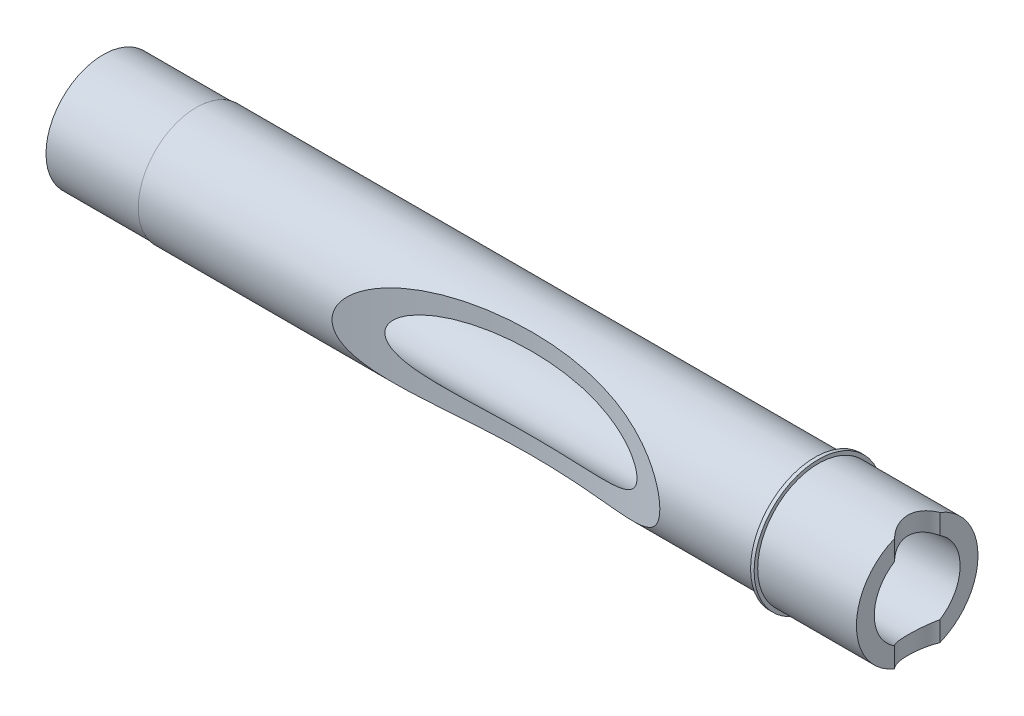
ISO-10303-21;
HEADER;
FILE_DESCRIPTION(('STEP AP214'),'2;1');
FILE_NAME('part.step','',(''),(''),'','','');
FILE_SCHEMA(('AUTOMOTIVE_DESIGN { 1 0 10303 214 1 1 1 1 }'));
ENDSEC;
DATA;
#1=APPLICATION_CONTEXT('core data for automotive mechanical design processes');
#2=APPLICATION_PROTOCOL_DEFINITION('international standard','automotive_design',2000,#1);
#3=PRODUCT_CONTEXT('',#1,'mechanical');
#4=PRODUCT('Part','Part','',(#3));
#5=PRODUCT_RELATED_PRODUCT_CATEGORY('part','',(#4));
#6=PRODUCT_DEFINITION_FORMATION('','',#4);
#7=PRODUCT_DEFINITION_CONTEXT('part definition',#1,'design');
#8=PRODUCT_DEFINITION('design','',#6,#7);
#9=PRODUCT_DEFINITION_SHAPE('','',#8);
#10=(LENGTH_UNIT() NAMED_UNIT(*) SI_UNIT(.MILLI.,.METRE.));
#11=(NAMED_UNIT(*) PLANE_ANGLE_UNIT() SI_UNIT($,.RADIAN.));
#12=(NAMED_UNIT(*) SI_UNIT($,.STERADIAN.) SOLID_ANGLE_UNIT());
#13=UNCERTAINTY_MEASURE_WITH_UNIT(LENGTH_MEASURE(1.E-05),#10,'distance_accuracy_value','');
#14=(GEOMETRIC_REPRESENTATION_CONTEXT(3) GLOBAL_UNCERTAINTY_ASSIGNED_CONTEXT((#13)) GLOBAL_UNIT_ASSIGNED_CONTEXT((#10,
#11,#12)) REPRESENTATION_CONTEXT('',''));
#15=CARTESIAN_POINT('',(0.,0.,0.));
#16=DIRECTION('',(0.,0.,1.));
#17=DIRECTION('',(1.,0.,0.));
#18=AXIS2_PLACEMENT_3D('',#15,#16,#17);
#19=CARTESIAN_POINT('',(56.49,0.,0.));
#20=DIRECTION('',(-1.,0.,0.));
#21=DIRECTION('',(0.,0.,1.));
#22=AXIS2_PLACEMENT_3D('',#19,#20,#21);
#23=CYLINDRICAL_SURFACE('',#22,6.8);
#24=CARTESIAN_POINT('',(-59.6,0.,0.));
#25=DIRECTION('',(-1.,0.,0.));
#26=DIRECTION('',(0.,1.,0.));
#27=AXIS2_PLACEMENT_3D('',#24,#25,#26);
#28=CIRCLE('',#27,6.80000000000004);
#29=CARTESIAN_POINT('',(-59.6,6.80000000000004,0.));
#30=VERTEX_POINT('',#29);
#31=EDGE_CURVE('E185',#30,#30,#28,.T.);
#32=ORIENTED_EDGE('',*,*,#31,.T.);
#33=EDGE_LOOP('',(#32));
#34=FACE_BOUND('',#33,.T.);
#35=CARTESIAN_POINT('',(-58.7,0.,0.));
#36=DIRECTION('',(-1.,0.,0.));
#37=DIRECTION('',(0.,1.,0.));
#38=AXIS2_PLACEMENT_3D('',#35,#36,#37);
#39=CIRCLE('',#38,6.80000000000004);
#40=CARTESIAN_POINT('',(-58.7,6.80000000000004,0.));
#41=VERTEX_POINT('',#40);
#42=EDGE_CURVE('E187',#41,#41,#39,.F.);
#43=ORIENTED_EDGE('',*,*,#42,.T.);
#44=EDGE_LOOP('',(#43));
#45=FACE_BOUND('',#44,.T.);
#46=ADVANCED_FACE('F16',(#34,#45),#23,.F.);
#47=CARTESIAN_POINT('',(-58.7,0.,0.));
#48=DIRECTION('',(-1.,0.,0.));
#49=DIRECTION('',(0.,1.,0.));
#50=AXIS2_PLACEMENT_3D('',#47,#48,#49);
#51=TOROIDAL_SURFACE('',#50,6.70000000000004,0.1);
#52=ORIENTED_EDGE('',*,*,#42,.F.);
#53=EDGE_LOOP('',(#52));
#54=FACE_BOUND('',#53,.T.);
#55=CARTESIAN_POINT('',(-58.6,0.,0.));
#56=DIRECTION('',(1.,0.,0.));
#57=DIRECTION('',(0.,-1.,0.));
#58=AXIS2_PLACEMENT_3D('',#55,#56,#57);
#59=CIRCLE('',#58,6.70000000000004);
#60=CARTESIAN_POINT('',(-58.6,6.70000000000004,0.));
#61=VERTEX_POINT('',#60);
#62=CARTESIAN_POINT('',(-58.6,-6.70000000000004,0.));
#63=VERTEX_POINT('',#62);
#64=EDGE_CURVE('E138',#61,#63,#59,.F.);
#65=ORIENTED_EDGE('',*,*,#64,.F.);
#66=CARTESIAN_POINT('',(-58.6,0.,0.));
#67=DIRECTION('',(1.,0.,0.));
#68=DIRECTION('',(0.,1.,0.));
#69=AXIS2_PLACEMENT_3D('',#66,#67,#68);
#70=CIRCLE('',#69,6.70000000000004);
#71=EDGE_CURVE('E150',#63,#61,#70,.F.);
#72=ORIENTED_EDGE('',*,*,#71,.F.);
#73=EDGE_LOOP('',(#65,#72));
#74=FACE_BOUND('',#73,.T.);
#75=ADVANCED_FACE('F166',(#54,#74),#51,.F.);
#76=CARTESIAN_POINT('',(-59.6,0.,0.));
#77=DIRECTION('',(-1.,0.,0.));
#78=DIRECTION('',(0.,1.,0.));
#79=AXIS2_PLACEMENT_3D('',#76,#77,#78);
#80=TOROIDAL_SURFACE('',#79,6.70000000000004,0.1);
#81=ORIENTED_EDGE('',*,*,#31,.F.);
#82=EDGE_LOOP('',(#81));
#83=FACE_BOUND('',#82,.T.);
#84=CARTESIAN_POINT('',(-59.7,0.,0.));
#85=DIRECTION('',(-1.,0.,0.));
#86=DIRECTION('',(0.,1.,0.));
#87=AXIS2_PLACEMENT_3D('',#84,#85,#86);
#88=CIRCLE('',#87,6.70000000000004);
#89=CARTESIAN_POINT('',(-59.7,6.70000000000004,0.));
#90=VERTEX_POINT('',#89);
#91=CARTESIAN_POINT('',(-59.7,-6.70000000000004,0.));
#92=VERTEX_POINT('',#91);
#93=EDGE_CURVE('E467',#90,#92,#88,.T.);
#94=ORIENTED_EDGE('',*,*,#93,.T.);
#95=CARTESIAN_POINT('',(-59.7,0.,0.));
#96=DIRECTION('',(-1.,0.,0.));
#97=DIRECTION('',(0.,-1.,0.));
#98=AXIS2_PLACEMENT_3D('',#95,#96,#97);
#99=CIRCLE('',#98,6.70000000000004);
#100=EDGE_CURVE('E102',#92,#90,#99,.T.);
#101=ORIENTED_EDGE('',*,*,#100,.T.);
#102=EDGE_LOOP('',(#94,#101));
#103=FACE_BOUND('',#102,.T.);
#104=ADVANCED_FACE('F163',(#83,#103),#80,.F.);
#105=CARTESIAN_POINT('',(-58.6,0.,0.));
#106=DIRECTION('',(-1.,0.,0.));
#107=DIRECTION('',(0.,0.,1.));
#108=AXIS2_PLACEMENT_3D('',#105,#106,#107);
#109=PLANE('',#108);
#110=ORIENTED_EDGE('',*,*,#64,.T.);
#111=ORIENTED_EDGE('',*,*,#71,.T.);
#112=EDGE_LOOP('',(#110,#111));
#113=FACE_BOUND('',#112,.T.);
#114=CARTESIAN_POINT('',(-58.6,0.,0.));
#115=DIRECTION('',(-1.,0.,0.));
#116=DIRECTION('',(0.,0.,1.));
#117=AXIS2_PLACEMENT_3D('',#114,#115,#116);
#118=CIRCLE('',#117,6.5);
#119=CARTESIAN_POINT('',(-58.6,0.,6.5));
#120=VERTEX_POINT('',#119);
#121=EDGE_CURVE('E466',#120,#120,#118,.F.);
#122=ORIENTED_EDGE('',*,*,#121,.T.);
#123=EDGE_LOOP('',(#122));
#124=FACE_BOUND('',#123,.T.);
#125=ADVANCED_FACE('F119',(#113,#124),#109,.T.);
#126=CARTESIAN_POINT('',(-59.7,0.,0.));
#127=DIRECTION('',(-1.,0.,0.));
#128=DIRECTION('',(0.,0.,1.));
#129=AXIS2_PLACEMENT_3D('',#126,#127,#128);
#130=PLANE('',#129);
#131=ORIENTED_EDGE('',*,*,#100,.F.);
#132=ORIENTED_EDGE('',*,*,#93,.F.);
#133=EDGE_LOOP('',(#131,#132));
#134=FACE_BOUND('',#133,.T.);
#135=CARTESIAN_POINT('',(-59.7,0.,0.));
#136=DIRECTION('',(-1.,0.,0.));
#137=DIRECTION('',(0.,0.,1.));
#138=AXIS2_PLACEMENT_3D('',#135,#136,#137);
#139=CIRCLE('',#138,6.5);
#140=CARTESIAN_POINT('',(-59.7,0.,6.5));
#141=VERTEX_POINT('',#140);
#142=EDGE_CURVE('E293',#141,#141,#139,.T.);
#143=ORIENTED_EDGE('',*,*,#142,.T.);
#144=EDGE_LOOP('',(#143));
#145=FACE_BOUND('',#144,.T.);
#146=ADVANCED_FACE('F108',(#134,#145),#130,.F.);
#147=CARTESIAN_POINT('',(56.49,0.,0.));
#148=DIRECTION('',(-1.,0.,0.));
#149=DIRECTION('',(0.,0.,1.));
#150=AXIS2_PLACEMENT_3D('',#147,#148,#149);
#151=CYLINDRICAL_SURFACE('',#150,6.5);
#152=ORIENTED_EDGE('',*,*,#121,.F.);
#153=EDGE_LOOP('',(#152));
#154=FACE_BOUND('',#153,.T.);
#155=CARTESIAN_POINT('',(-54.,0.,0.));
#156=DIRECTION('',(-1.,0.,0.));
#157=DIRECTION('',(0.,0.,1.));
#158=AXIS2_PLACEMENT_3D('',#155,#156,#157);
#159=CIRCLE('',#158,6.5);
#160=CARTESIAN_POINT('',(-54.,0.,6.5));
#161=VERTEX_POINT('',#160);
#162=EDGE_CURVE('E70',#161,#161,#159,.T.);
#163=ORIENTED_EDGE('',*,*,#162,.F.);
#164=EDGE_LOOP('',(#163));
#165=FACE_BOUND('',#164,.T.);
#166=ADVANCED_FACE('F118',(#154,#165),#151,.F.);
#167=CARTESIAN_POINT('',(56.49,0.,0.));
#168=DIRECTION('',(-1.,0.,0.));
#169=DIRECTION('',(0.,0.,1.));
#170=AXIS2_PLACEMENT_3D('',#167,#168,#169);
#171=CYLINDRICAL_SURFACE('',#170,8.5);
#172=CARTESIAN_POINT('',(50.7999999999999,7.88923316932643,3.16385840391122));
#173=CARTESIAN_POINT('',(50.7137894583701,7.92420994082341,3.07666353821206));
#174=CARTESIAN_POINT('',(50.6310821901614,7.95893010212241,2.98588239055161));
#175=CARTESIAN_POINT('',(50.4731123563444,8.02706792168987,2.79753071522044));
#176=CARTESIAN_POINT('',(50.397853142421,8.0604849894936,2.69995716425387));
#177=CARTESIAN_POINT('',(50.254978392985,8.1253385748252,2.49803435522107));
#178=CARTESIAN_POINT('',(50.1873983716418,8.15676561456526,2.39365687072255));
#179=CARTESIAN_POINT('',(50.0608022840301,8.21670051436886,2.17904549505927));
#180=CARTESIAN_POINT('',(50.0017850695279,8.24520876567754,2.06881239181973));
#181=CARTESIAN_POINT('',(49.8926515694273,8.29867703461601,1.84268895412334));
#182=CARTESIAN_POINT('',(49.8425672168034,8.32362426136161,1.72678013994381));
#183=CARTESIAN_POINT('',(49.7520974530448,8.36917843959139,1.49041397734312));
#184=CARTESIAN_POINT('',(49.7117112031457,8.3897857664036,1.36995702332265));
#185=CARTESIAN_POINT('',(49.6412054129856,8.4260416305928,1.12562888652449));
#186=CARTESIAN_POINT('',(49.6110637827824,8.44170083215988,1.00176568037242));
#187=CARTESIAN_POINT('',(49.5613401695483,8.46765906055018,0.751388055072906));
#188=CARTESIAN_POINT('',(49.5417571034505,8.47795863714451,0.624873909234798));
#189=CARTESIAN_POINT('',(49.5145718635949,8.49228739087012,0.380538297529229));
#190=CARTESIAN_POINT('',(49.5061337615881,8.49675373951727,0.262834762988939));
#191=CARTESIAN_POINT('',(49.498534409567,8.50077533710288,0.0270018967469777));
#192=CARTESIAN_POINT('',(49.4993762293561,8.50032896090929,-0.0911275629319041));
#193=CARTESIAN_POINT('',(49.5103324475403,8.49453314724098,-0.326798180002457));
#194=CARTESIAN_POINT('',(49.5204441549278,8.48918513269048,-0.444339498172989));
#195=CARTESIAN_POINT('',(49.5498102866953,8.47372604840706,-0.677999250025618));
#196=CARTESIAN_POINT('',(49.5690681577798,8.46361318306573,-0.794117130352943));
#197=CARTESIAN_POINT('',(49.6153330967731,8.4394865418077,-1.01840924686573));
#198=CARTESIAN_POINT('',(49.6419156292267,8.42568747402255,-1.12669442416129));
#199=CARTESIAN_POINT('',(49.7028599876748,8.39432766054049,-1.34050862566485));
#200=CARTESIAN_POINT('',(49.7372244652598,8.37676563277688,-1.44603669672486));
#201=CARTESIAN_POINT('',(49.8515612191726,8.31896399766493,-1.75765577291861));
#202=CARTESIAN_POINT('',(49.9427797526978,8.27360725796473,-1.95879567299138));
#203=CARTESIAN_POINT('',(50.1493317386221,8.1743316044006,-2.33833495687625));
#204=CARTESIAN_POINT('',(50.2639348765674,8.1206817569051,-2.5172068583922));
#205=CARTESIAN_POINT('',(50.452776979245,8.03614592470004,-2.77097558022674));
#206=CARTESIAN_POINT('',(50.5184685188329,8.00732323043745,-2.85306246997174));
#207=CARTESIAN_POINT('',(50.6552481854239,7.94880861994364,-3.01224710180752));
#208=CARTESIAN_POINT('',(50.7263350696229,7.91911690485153,-3.08934598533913));
#209=CARTESIAN_POINT('',(50.8,7.88923316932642,-3.16385840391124));
#210=B_SPLINE_CURVE_WITH_KNOTS('',3,(#172,#173,#174,#175,#176,#177,#178,#179,#180,#181,#182,
#183,#184,#185,#186,#187,#188,#189,#190,#191,#192,#193,#194,#195,#196,#197,#198,#199,#200,#201,
#202,#203,#204,#205,#206,#207,#208,#209),.UNSPECIFIED.,.F.,.F.,(4,2,2,2,2,2,2,2,2,2,2,2,2,2,2,2,
2,2,4),(0.,0.382449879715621,0.765071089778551,1.14939540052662,1.53366812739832,
1.91928815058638,2.30487481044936,2.68962469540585,3.0743351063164,3.42814735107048,
3.78207664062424,4.13590321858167,4.48986324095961,4.82653115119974,5.16331394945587,
5.83683677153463,6.49188002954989,6.81870814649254,7.14546120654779),.UNSPECIFIED.);
#211=CARTESIAN_POINT('',(50.8,7.88923316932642,3.16385840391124));
#212=VERTEX_POINT('',#211);
#213=CARTESIAN_POINT('',(50.8,7.88923316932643,-3.16385840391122));
#214=VERTEX_POINT('',#213);
#215=EDGE_CURVE('E72',#212,#214,#210,.T.);
#216=ORIENTED_EDGE('',*,*,#215,.T.);
#217=CARTESIAN_POINT('',(50.8,0.,0.));
#218=DIRECTION('',(-1.,0.,0.));
#219=DIRECTION('',(0.,0.,1.));
#220=AXIS2_PLACEMENT_3D('',#217,#218,#219);
#221=CIRCLE('',#220,8.5);
#222=CARTESIAN_POINT('',(50.8,-7.88923316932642,-3.16385840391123));
#223=VERTEX_POINT('',#222);
#224=EDGE_CURVE('E63',#214,#223,#221,.T.);
#225=ORIENTED_EDGE('',*,*,#224,.T.);
#226=CARTESIAN_POINT('',(50.7999999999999,-7.88923316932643,-3.16385840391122));
#227=CARTESIAN_POINT('',(50.7137894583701,-7.92420994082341,-3.07666353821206));
#228=CARTESIAN_POINT('',(50.6310821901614,-7.95893010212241,-2.98588239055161));
#229=CARTESIAN_POINT('',(50.4731123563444,-8.02706792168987,-2.79753071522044));
#230=CARTESIAN_POINT('',(50.397853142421,-8.0604849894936,-2.69995716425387));
#231=CARTESIAN_POINT('',(50.254978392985,-8.1253385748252,-2.49803435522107));
#232=CARTESIAN_POINT('',(50.1873983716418,-8.15676561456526,-2.39365687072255));
#233=CARTESIAN_POINT('',(50.0608022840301,-8.21670051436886,-2.17904549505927));
#234=CARTESIAN_POINT('',(50.0017850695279,-8.24520876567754,-2.06881239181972));
#235=CARTESIAN_POINT('',(49.8926515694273,-8.29867703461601,-1.84268895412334));
#236=CARTESIAN_POINT('',(49.8425672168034,-8.32362426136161,-1.72678013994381));
#237=CARTESIAN_POINT('',(49.7520974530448,-8.3691784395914,-1.49041397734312));
#238=CARTESIAN_POINT('',(49.7117112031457,-8.3897857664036,-1.36995702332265));
#239=CARTESIAN_POINT('',(49.6412054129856,-8.42604163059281,-1.12562888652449));
#240=CARTESIAN_POINT('',(49.6110637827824,-8.44170083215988,-1.00176568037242));
#241=CARTESIAN_POINT('',(49.5613401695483,-8.46765906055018,-0.751388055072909));
#242=CARTESIAN_POINT('',(49.5417571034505,-8.47795863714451,-0.6248739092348));
#243=CARTESIAN_POINT('',(49.5145718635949,-8.49228739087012,-0.380538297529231));
#244=CARTESIAN_POINT('',(49.5061337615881,-8.49675373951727,-0.26283476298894));
#245=CARTESIAN_POINT('',(49.498534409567,-8.50077533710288,-0.0270018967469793));
#246=CARTESIAN_POINT('',(49.4993762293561,-8.50032896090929,0.0911275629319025));
#247=CARTESIAN_POINT('',(49.5103324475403,-8.49453314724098,0.326798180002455));
#248=CARTESIAN_POINT('',(49.5204441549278,-8.48918513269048,0.444339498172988));
#249=CARTESIAN_POINT('',(49.5498102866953,-8.47372604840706,0.677999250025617));
#250=CARTESIAN_POINT('',(49.5690681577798,-8.46361318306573,0.794117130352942));
#251=CARTESIAN_POINT('',(49.6153330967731,-8.4394865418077,1.01840924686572));
#252=CARTESIAN_POINT('',(49.6419156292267,-8.42568747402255,1.12669442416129));
#253=CARTESIAN_POINT('',(49.7028599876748,-8.39432766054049,1.34050862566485));
#254=CARTESIAN_POINT('',(49.7372244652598,-8.37676563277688,1.44603669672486));
#255=CARTESIAN_POINT('',(49.8515612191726,-8.31896399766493,1.75765577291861));
#256=CARTESIAN_POINT('',(49.9427797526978,-8.27360725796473,1.95879567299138));
#257=CARTESIAN_POINT('',(50.1493317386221,-8.1743316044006,2.33833495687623));
#258=CARTESIAN_POINT('',(50.2639348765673,-8.12068175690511,2.51720685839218));
#259=CARTESIAN_POINT('',(50.452776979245,-8.03614592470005,2.77097558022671));
#260=CARTESIAN_POINT('',(50.5184685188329,-8.00732323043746,2.85306246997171));
#261=CARTESIAN_POINT('',(50.6552481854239,-7.94880861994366,3.01224710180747));
#262=CARTESIAN_POINT('',(50.7263350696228,-7.91911690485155,3.08934598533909));
#263=CARTESIAN_POINT('',(50.7999999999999,-7.88923316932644,3.16385840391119));
#264=B_SPLINE_CURVE_WITH_KNOTS('',3,(#226,#227,#228,#229,#230,#231,#232,#233,#234,#235,#236,
#237,#238,#239,#240,#241,#242,#243,#244,#245,#246,#247,#248,#249,#250,#251,#252,#253,#254,#255,
#256,#257,#258,#259,#260,#261,#262,#263),.UNSPECIFIED.,.F.,.F.,(4,2,2,2,2,2,2,2,2,2,2,2,2,2,2,2,
2,2,4),(0.,0.382449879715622,0.765071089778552,1.14939540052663,1.53366812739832,
1.91928815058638,2.30487481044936,2.68962469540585,3.0743351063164,3.42814735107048,
3.78207664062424,4.13590321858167,4.48986324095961,4.82653115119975,5.16331394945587,
5.83683677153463,6.49188002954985,6.81870814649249,7.14546120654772),.UNSPECIFIED.);
#265=CARTESIAN_POINT('',(50.7999999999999,-7.88923316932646,3.16385840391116));
#266=VERTEX_POINT('',#265);
#267=EDGE_CURVE('E78',#223,#266,#264,.T.);
#268=ORIENTED_EDGE('',*,*,#267,.T.);
#269=CARTESIAN_POINT('',(50.8,0.,0.));
#270=DIRECTION('',(-1.,0.,0.));
#271=DIRECTION('',(0.,0.,1.));
#272=AXIS2_PLACEMENT_3D('',#269,#270,#271);
#273=CIRCLE('',#272,8.5);
#274=EDGE_CURVE('E57',#266,#212,#273,.T.);
#275=ORIENTED_EDGE('',*,*,#274,.T.);
#276=EDGE_LOOP('',(#216,#225,#268,#275));
#277=FACE_BOUND('',#276,.T.);
#278=CARTESIAN_POINT('',(37.,0.,0.));
#279=DIRECTION('',(-1.,0.,0.));
#280=DIRECTION('',(0.,0.,1.));
#281=AXIS2_PLACEMENT_3D('',#278,#279,#280);
#282=CIRCLE('',#281,8.5);
#283=CARTESIAN_POINT('',(37.,0.,8.5));
#284=VERTEX_POINT('',#283);
#285=EDGE_CURVE('E79',#284,#284,#282,.F.);
#286=ORIENTED_EDGE('',*,*,#285,.T.);
#287=EDGE_LOOP('',(#286));
#288=FACE_BOUND('',#287,.T.);
#289=ADVANCED_FACE('F73',(#277,#288),#171,.T.);
#290=CARTESIAN_POINT('',(56.49,0.,0.));
#291=DIRECTION('',(-1.,0.,0.));
#292=DIRECTION('',(0.,0.,1.));
#293=AXIS2_PLACEMENT_3D('',#290,#291,#292);
#294=CYLINDRICAL_SURFACE('',#293,6.5);
#295=ORIENTED_EDGE('',*,*,#142,.F.);
#296=EDGE_LOOP('',(#295));
#297=FACE_BOUND('',#296,.T.);
#298=CARTESIAN_POINT('',(-63.,0.,0.));
#299=DIRECTION('',(-1.,0.,0.));
#300=DIRECTION('',(0.,0.,1.));
#301=AXIS2_PLACEMENT_3D('',#298,#299,#300);
#302=CIRCLE('',#301,6.5);
#303=CARTESIAN_POINT('',(-63.,0.,6.5));
#304=VERTEX_POINT('',#303);
#305=EDGE_CURVE('E85',#304,#304,#302,.F.);
#306=ORIENTED_EDGE('',*,*,#305,.F.);
#307=EDGE_LOOP('',(#306));
#308=FACE_BOUND('',#307,.T.);
#309=ADVANCED_FACE('F282',(#297,#308),#294,.F.);
#310=CARTESIAN_POINT('',(37.,0.,0.));
#311=DIRECTION('',(-1.,0.,0.));
#312=DIRECTION('',(0.,0.,1.));
#313=AXIS2_PLACEMENT_3D('',#310,#311,#312);
#314=PLANE('',#313);
#315=CARTESIAN_POINT('',(37.,0.,0.));
#316=DIRECTION('',(-1.,0.,0.));
#317=DIRECTION('',(0.,0.,1.));
#318=AXIS2_PLACEMENT_3D('',#315,#316,#317);
#319=CIRCLE('',#318,9.);
#320=CARTESIAN_POINT('',(37.,0.,9.));
#321=VERTEX_POINT('',#320);
#322=EDGE_CURVE('E88',#321,#321,#319,.T.);
#323=ORIENTED_EDGE('',*,*,#322,.F.);
#324=EDGE_LOOP('',(#323));
#325=FACE_BOUND('',#324,.T.);
#326=ORIENTED_EDGE('',*,*,#285,.F.);
#327=EDGE_LOOP('',(#326));
#328=FACE_BOUND('',#327,.T.);
#329=ADVANCED_FACE('F265',(#325,#328),#314,.F.);
#330=CARTESIAN_POINT('',(54.,-45.48,0.));
#331=DIRECTION('',(0.,1.,0.));
#332=DIRECTION('',(0.,0.,1.));
#333=AXIS2_PLACEMENT_3D('',#330,#331,#332);
#334=CYLINDRICAL_SURFACE('',#333,4.5);
#335=DIRECTION('',(0.,1.,0.));
#336=VECTOR('',#335,1.);
#337=CARTESIAN_POINT('',(50.8,0.,-3.16385840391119));
#338=LINE('',#337,#336);
#339=CARTESIAN_POINT('',(50.7999999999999,5.0980388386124,-3.1638584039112));
#340=VERTEX_POINT('',#339);
#341=EDGE_CURVE('E67',#340,#214,#338,.T.);
#342=ORIENTED_EDGE('',*,*,#341,.T.);
#343=ORIENTED_EDGE('',*,*,#215,.F.);
#344=DIRECTION('',(0.,1.,0.));
#345=VECTOR('',#344,1.);
#346=CARTESIAN_POINT('',(50.8,0.,3.1638584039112));
#347=LINE('',#346,#345);
#348=CARTESIAN_POINT('',(50.8,5.09803883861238,3.16385840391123));
#349=VERTEX_POINT('',#348);
#350=EDGE_CURVE('E92',#212,#349,#347,.F.);
#351=ORIENTED_EDGE('',*,*,#350,.T.);
#352=CARTESIAN_POINT('',(50.8,5.09803883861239,3.16385840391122));
#353=CARTESIAN_POINT('',(50.7175465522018,5.14981053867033,3.08045198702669));
#354=CARTESIAN_POINT('',(50.6380990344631,5.20087544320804,2.99358530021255));
#355=CARTESIAN_POINT('',(50.4856103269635,5.30071362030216,2.81301672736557));
#356=CARTESIAN_POINT('',(50.4125750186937,5.34948477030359,2.719308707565));
#357=CARTESIAN_POINT('',(50.2727957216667,5.44420788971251,2.52437319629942));
#358=CARTESIAN_POINT('',(50.2061180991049,5.49012867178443,2.42308272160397));
#359=CARTESIAN_POINT('',(50.080476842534,5.57769033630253,2.21409124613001));
#360=CARTESIAN_POINT('',(50.0215113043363,5.61933227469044,2.10639183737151));
#361=CARTESIAN_POINT('',(49.9116098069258,5.69766975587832,1.88428048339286));
#362=CARTESIAN_POINT('',(49.8607276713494,5.73433192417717,1.76982997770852));
#363=CARTESIAN_POINT('',(49.7682068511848,5.80147048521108,1.53550854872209));
#364=CARTESIAN_POINT('',(49.7265665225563,5.83194797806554,1.41563859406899));
#365=CARTESIAN_POINT('',(49.6534049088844,5.88576905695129,1.17185203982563));
#366=CARTESIAN_POINT('',(49.6218418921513,5.90914204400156,1.04795453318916));
#367=CARTESIAN_POINT('',(49.5692418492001,5.94821877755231,0.796766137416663));
#368=CARTESIAN_POINT('',(49.548202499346,5.96392421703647,0.669476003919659));
#369=CARTESIAN_POINT('',(49.5193200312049,5.98551723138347,0.431060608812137));
#370=CARTESIAN_POINT('',(49.5100275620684,5.99248205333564,0.320205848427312));
#371=CARTESIAN_POINT('',(49.499689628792,6.0002317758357,0.0979030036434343));
#372=CARTESIAN_POINT('',(49.4986432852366,6.00101733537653,-0.0135450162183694));
#373=CARTESIAN_POINT('',(49.5048210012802,5.99638466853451,-0.236145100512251));
#374=CARTESIAN_POINT('',(49.5120494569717,5.99096314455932,-0.347296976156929));
#375=CARTESIAN_POINT('',(49.5346421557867,5.97405800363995,-0.56827329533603));
#376=CARTESIAN_POINT('',(49.5500062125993,5.96257452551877,-0.678097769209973));
#377=CARTESIAN_POINT('',(49.6046274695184,5.9218844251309,-0.985555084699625));
#378=CARTESIAN_POINT('',(49.6531372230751,5.88587393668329,-1.18074595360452));
#379=CARTESIAN_POINT('',(49.7741252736,5.7970977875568,-1.5593583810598));
#380=CARTESIAN_POINT('',(49.8466104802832,5.74432729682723,-1.74277652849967));
#381=CARTESIAN_POINT('',(50.0202260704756,5.62001684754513,-2.11104832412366));
#382=CARTESIAN_POINT('',(50.1233598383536,5.54720768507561,-2.2945200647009));
#383=CARTESIAN_POINT('',(50.3512768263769,5.39039229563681,-2.64196721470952));
#384=CARTESIAN_POINT('',(50.4760478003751,5.30639240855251,-2.80595356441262));
#385=CARTESIAN_POINT('',(50.6408927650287,5.19933305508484,-2.99475780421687));
#386=CARTESIAN_POINT('',(50.6720618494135,5.17924525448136,-3.02935498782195));
#387=CARTESIAN_POINT('',(50.7353277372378,5.13882200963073,-3.09742948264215));
#388=CARTESIAN_POINT('',(50.7674231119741,5.11848697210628,-3.13090836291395));
#389=CARTESIAN_POINT('',(50.7999999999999,5.09803883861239,-3.16385840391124));
#390=B_SPLINE_CURVE_WITH_KNOTS('',3,(#352,#353,#354,#355,#356,#357,#358,#359,#360,#361,#362,
#363,#364,#365,#366,#367,#368,#369,#370,#371,#372,#373,#374,#375,#376,#377,#378,#379,#380,#381,
#382,#383,#384,#385,#386,#387,#388,#389),.UNSPECIFIED.,.F.,.F.,(4,2,2,2,2,2,2,2,2,2,2,2,2,2,2,2,
2,2,4),(0.,0.384568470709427,0.769486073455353,1.1580607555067,1.54653931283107,
1.93750497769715,2.32840103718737,2.71765668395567,3.10682634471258,3.44074881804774,
3.77463567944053,4.10870000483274,4.4427566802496,5.05289068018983,5.66320067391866,
6.32892747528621,6.99427871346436,7.14641381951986,7.29832564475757),.UNSPECIFIED.);
#391=EDGE_CURVE('E84',#349,#340,#390,.T.);
#392=ORIENTED_EDGE('',*,*,#391,.T.);
#393=EDGE_LOOP('',(#342,#343,#351,#392));
#394=FACE_BOUND('',#393,.T.);
#395=ADVANCED_FACE('F82',(#394),#334,.F.);
#396=CARTESIAN_POINT('',(54.,-45.48,0.));
#397=DIRECTION('',(0.,1.,0.));
#398=DIRECTION('',(0.,0.,1.));
#399=AXIS2_PLACEMENT_3D('',#396,#397,#398);
#400=CYLINDRICAL_SURFACE('',#399,4.5);
#401=DIRECTION('',(0.,1.,0.));
#402=VECTOR('',#401,1.);
#403=CARTESIAN_POINT('',(50.8,0.,-3.1638584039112));
#404=LINE('',#403,#402);
#405=CARTESIAN_POINT('',(50.8,-5.09803883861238,-3.16385840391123));
#406=VERTEX_POINT('',#405);
#407=EDGE_CURVE('E68',#223,#406,#404,.T.);
#408=ORIENTED_EDGE('',*,*,#407,.T.);
#409=CARTESIAN_POINT('',(50.8,-5.09803883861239,-3.16385840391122));
#410=CARTESIAN_POINT('',(50.7175465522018,-5.14981053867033,-3.08045198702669));
#411=CARTESIAN_POINT('',(50.6380990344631,-5.20087544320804,-2.99358530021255));
#412=CARTESIAN_POINT('',(50.4856103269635,-5.30071362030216,-2.81301672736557));
#413=CARTESIAN_POINT('',(50.4125750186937,-5.34948477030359,-2.719308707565));
#414=CARTESIAN_POINT('',(50.2727957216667,-5.44420788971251,-2.52437319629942));
#415=CARTESIAN_POINT('',(50.2061180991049,-5.49012867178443,-2.42308272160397));
#416=CARTESIAN_POINT('',(50.080476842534,-5.57769033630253,-2.21409124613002));
#417=CARTESIAN_POINT('',(50.0215113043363,-5.61933227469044,-2.10639183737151));
#418=CARTESIAN_POINT('',(49.9116098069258,-5.69766975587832,-1.88428048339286));
#419=CARTESIAN_POINT('',(49.8607276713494,-5.73433192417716,-1.76982997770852));
#420=CARTESIAN_POINT('',(49.7682068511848,-5.80147048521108,-1.53550854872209));
#421=CARTESIAN_POINT('',(49.7265665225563,-5.83194797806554,-1.41563859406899));
#422=CARTESIAN_POINT('',(49.6534049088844,-5.88576905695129,-1.17185203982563));
#423=CARTESIAN_POINT('',(49.6218418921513,-5.90914204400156,-1.04795453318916));
#424=CARTESIAN_POINT('',(49.5692418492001,-5.94821877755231,-0.796766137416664));
#425=CARTESIAN_POINT('',(49.548202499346,-5.96392421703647,-0.66947600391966));
#426=CARTESIAN_POINT('',(49.5193200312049,-5.98551723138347,-0.431060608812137));
#427=CARTESIAN_POINT('',(49.5100275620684,-5.99248205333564,-0.320205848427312));
#428=CARTESIAN_POINT('',(49.499689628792,-6.0002317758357,-0.0979030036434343));
#429=CARTESIAN_POINT('',(49.4986432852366,-6.00101733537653,0.0135450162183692));
#430=CARTESIAN_POINT('',(49.5048210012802,-5.99638466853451,0.236145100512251));
#431=CARTESIAN_POINT('',(49.5120494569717,-5.99096314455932,0.347296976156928));
#432=CARTESIAN_POINT('',(49.5346421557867,-5.97405800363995,0.568273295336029));
#433=CARTESIAN_POINT('',(49.5500062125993,-5.96257452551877,0.678097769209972));
#434=CARTESIAN_POINT('',(49.6046274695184,-5.9218844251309,0.985555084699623));
#435=CARTESIAN_POINT('',(49.6531372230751,-5.88587393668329,1.18074595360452));
#436=CARTESIAN_POINT('',(49.7741252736,-5.7970977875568,1.5593583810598));
#437=CARTESIAN_POINT('',(49.8466104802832,-5.74432729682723,1.74277652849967));
#438=CARTESIAN_POINT('',(50.0202260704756,-5.62001684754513,2.11104832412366));
#439=CARTESIAN_POINT('',(50.1233598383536,-5.54720768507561,2.2945200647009));
#440=CARTESIAN_POINT('',(50.3512768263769,-5.39039229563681,2.64196721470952));
#441=CARTESIAN_POINT('',(50.4760478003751,-5.30639240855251,2.80595356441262));
#442=CARTESIAN_POINT('',(50.6408927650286,-5.19933305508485,2.99475780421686));
#443=CARTESIAN_POINT('',(50.6720618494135,-5.17924525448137,3.02935498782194));
#444=CARTESIAN_POINT('',(50.7353277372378,-5.13882200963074,3.09742948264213));
#445=CARTESIAN_POINT('',(50.767423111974,-5.1184869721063,3.13090836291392));
#446=CARTESIAN_POINT('',(50.7999999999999,-5.09803883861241,3.16385840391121));
#447=B_SPLINE_CURVE_WITH_KNOTS('',3,(#409,#410,#411,#412,#413,#414,#415,#416,#417,#418,#419,
#420,#421,#422,#423,#424,#425,#426,#427,#428,#429,#430,#431,#432,#433,#434,#435,#436,#437,#438,
#439,#440,#441,#442,#443,#444,#445,#446),.UNSPECIFIED.,.F.,.F.,(4,2,2,2,2,2,2,2,2,2,2,2,2,2,2,2,
2,2,4),(0.,0.384568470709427,0.769486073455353,1.1580607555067,1.54653931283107,
1.93750497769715,2.32840103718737,2.71765668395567,3.10682634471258,3.44074881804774,
3.77463567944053,4.10870000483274,4.4427566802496,5.05289068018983,5.66320067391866,
6.32892747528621,6.99427871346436,7.14641381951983,7.29832564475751),.UNSPECIFIED.);
#448=CARTESIAN_POINT('',(50.7999999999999,-5.09803883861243,3.16385840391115));
#449=VERTEX_POINT('',#448);
#450=EDGE_CURVE('E35',#406,#449,#447,.T.);
#451=ORIENTED_EDGE('',*,*,#450,.T.);
#452=DIRECTION('',(0.,1.,0.));
#453=VECTOR('',#452,1.);
#454=CARTESIAN_POINT('',(50.8,0.,3.16385840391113));
#455=LINE('',#454,#453);
#456=EDGE_CURVE('E94',#449,#266,#455,.F.);
#457=ORIENTED_EDGE('',*,*,#456,.T.);
#458=ORIENTED_EDGE('',*,*,#267,.F.);
#459=EDGE_LOOP('',(#408,#451,#457,#458));
#460=FACE_BOUND('',#459,.T.);
#461=ADVANCED_FACE('F264',(#460),#400,.F.);
#462=CARTESIAN_POINT('',(50.8,0.,0.));
#463=DIRECTION('',(-1.,0.,0.));
#464=DIRECTION('',(0.,0.,1.));
#465=AXIS2_PLACEMENT_3D('',#462,#463,#464);
#466=PLANE('',#465);
#467=ORIENTED_EDGE('',*,*,#274,.F.);
#468=ORIENTED_EDGE('',*,*,#456,.F.);
#469=CARTESIAN_POINT('',(50.8,0.,0.));
#470=DIRECTION('',(-1.,0.,0.));
#471=DIRECTION('',(0.,0.,1.));
#472=AXIS2_PLACEMENT_3D('',#469,#470,#471);
#473=CIRCLE('',#472,6.);
#474=EDGE_CURVE('E322',#449,#349,#473,.T.);
#475=ORIENTED_EDGE('',*,*,#474,.T.);
#476=ORIENTED_EDGE('',*,*,#350,.F.);
#477=EDGE_LOOP('',(#467,#468,#475,#476));
#478=FACE_BOUND('',#477,.T.);
#479=ADVANCED_FACE('F309',(#478),#466,.F.);
#480=CARTESIAN_POINT('',(-54.,0.,0.));
#481=DIRECTION('',(-1.,0.,0.));
#482=DIRECTION('',(0.,0.,1.));
#483=AXIS2_PLACEMENT_3D('',#480,#481,#482);
#484=PLANE('',#483);
#485=ORIENTED_EDGE('',*,*,#162,.T.);
#486=EDGE_LOOP('',(#485));
#487=FACE_BOUND('',#486,.T.);
#488=CARTESIAN_POINT('',(-54.,0.,0.));
#489=DIRECTION('',(-1.,0.,0.));
#490=DIRECTION('',(0.,0.,1.));
#491=AXIS2_PLACEMENT_3D('',#488,#489,#490);
#492=CIRCLE('',#491,6.);
#493=CARTESIAN_POINT('',(-54.,0.,6.));
#494=VERTEX_POINT('',#493);
#495=EDGE_CURVE('E320',#494,#494,#492,.F.);
#496=ORIENTED_EDGE('',*,*,#495,.T.);
#497=EDGE_LOOP('',(#496));
#498=FACE_BOUND('',#497,.T.);
#499=ADVANCED_FACE('F304',(#487,#498),#484,.T.);
#500=CARTESIAN_POINT('',(50.8,0.,0.));
#501=DIRECTION('',(-1.,0.,0.));
#502=DIRECTION('',(0.,0.,1.));
#503=AXIS2_PLACEMENT_3D('',#500,#501,#502);
#504=PLANE('',#503);
#505=ORIENTED_EDGE('',*,*,#341,.F.);
#506=CARTESIAN_POINT('',(50.8,0.,0.));
#507=DIRECTION('',(-1.,0.,0.));
#508=DIRECTION('',(0.,0.,1.));
#509=AXIS2_PLACEMENT_3D('',#506,#507,#508);
#510=CIRCLE('',#509,6.);
#511=EDGE_CURVE('E317',#340,#406,#510,.T.);
#512=ORIENTED_EDGE('',*,*,#511,.T.);
#513=ORIENTED_EDGE('',*,*,#407,.F.);
#514=ORIENTED_EDGE('',*,*,#224,.F.);
#515=EDGE_LOOP('',(#505,#512,#513,#514));
#516=FACE_BOUND('',#515,.T.);
#517=ADVANCED_FACE('F64',(#516),#504,.F.);
#518=CARTESIAN_POINT('',(-63.,0.,0.));
#519=DIRECTION('',(-1.,0.,0.));
#520=DIRECTION('',(0.,0.,1.));
#521=AXIS2_PLACEMENT_3D('',#518,#519,#520);
#522=PLANE('',#521);
#523=CARTESIAN_POINT('',(-63.,0.,0.));
#524=DIRECTION('',(-1.,0.,0.));
#525=DIRECTION('',(0.,0.,1.));
#526=AXIS2_PLACEMENT_3D('',#523,#524,#525);
#527=CIRCLE('',#526,8.);
#528=CARTESIAN_POINT('',(-63.,0.,8.));
#529=VERTEX_POINT('',#528);
#530=EDGE_CURVE('E319',#529,#529,#527,.F.);
#531=ORIENTED_EDGE('',*,*,#530,.F.);
#532=EDGE_LOOP('',(#531));
#533=FACE_BOUND('',#532,.T.);
#534=ORIENTED_EDGE('',*,*,#305,.T.);
#535=EDGE_LOOP('',(#534));
#536=FACE_BOUND('',#535,.T.);
#537=ADVANCED_FACE('F296',(#533,#536),#522,.T.);
#538=CARTESIAN_POINT('',(56.49,0.,0.));
#539=DIRECTION('',(-1.,0.,0.));
#540=DIRECTION('',(0.,0.,1.));
#541=AXIS2_PLACEMENT_3D('',#538,#539,#540);
#542=CYLINDRICAL_SURFACE('',#541,9.);
#543=ORIENTED_EDGE('',*,*,#322,.T.);
#544=EDGE_LOOP('',(#543));
#545=FACE_BOUND('',#544,.T.);
#546=CARTESIAN_POINT('',(36.5,0.,0.));
#547=DIRECTION('',(-1.,0.,0.));
#548=DIRECTION('',(0.,0.,1.));
#549=AXIS2_PLACEMENT_3D('',#546,#547,#548);
#550=CIRCLE('',#549,9.);
#551=CARTESIAN_POINT('',(36.5,0.,9.));
#552=VERTEX_POINT('',#551);
#553=EDGE_CURVE('E231',#552,#552,#550,.T.);
#554=ORIENTED_EDGE('',*,*,#553,.F.);
#555=EDGE_LOOP('',(#554));
#556=FACE_BOUND('',#555,.T.);
#557=ADVANCED_FACE('F244',(#545,#556),#542,.T.);
#558=CARTESIAN_POINT('',(56.49,0.,0.));
#559=DIRECTION('',(-1.,0.,0.));
#560=DIRECTION('',(0.,0.,1.));
#561=AXIS2_PLACEMENT_3D('',#558,#559,#560);
#562=CYLINDRICAL_SURFACE('',#561,6.);
#563=CARTESIAN_POINT('',(0.,5.13711981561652,3.10000000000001));
#564=CARTESIAN_POINT('',(-0.507909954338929,5.13712197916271,3.10000019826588));
#565=CARTESIAN_POINT('',(-1.0158307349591,5.13289366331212,3.10703693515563));
#566=CARTESIAN_POINT('',(-2.03117469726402,5.11575621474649,3.13517226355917));
#567=CARTESIAN_POINT('',(-2.53859783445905,5.10284636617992,3.15627201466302));
#568=CARTESIAN_POINT('',(-3.55285949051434,5.0676247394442,3.21252045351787));
#569=CARTESIAN_POINT('',(-4.05969690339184,5.04530349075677,3.24768329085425));
#570=CARTESIAN_POINT('',(-5.07160815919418,4.99003874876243,3.33197522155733));
#571=CARTESIAN_POINT('',(-5.57668210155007,4.95709586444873,3.38110351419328));
#572=CARTESIAN_POINT('',(-6.58236463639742,4.87891321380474,3.49297281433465));
#573=CARTESIAN_POINT('',(-7.08298297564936,4.83372225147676,3.55565960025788));
#574=CARTESIAN_POINT('',(-8.08087362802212,4.72841675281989,3.69454713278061));
#575=CARTESIAN_POINT('',(-8.5781453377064,4.66829959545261,3.770750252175));
#576=CARTESIAN_POINT('',(-9.56713861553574,4.52971119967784,3.93616853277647));
#577=CARTESIAN_POINT('',(-10.0588682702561,4.451271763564,4.02536104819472));
#578=CARTESIAN_POINT('',(-10.7912743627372,4.31603239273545,4.16846631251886));
#579=CARTESIAN_POINT('',(-11.0345051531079,4.26803196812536,4.2177118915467));
#580=CARTESIAN_POINT('',(-11.5189102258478,4.16531650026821,4.31918646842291));
#581=CARTESIAN_POINT('',(-11.7600847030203,4.11060210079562,4.37141517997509));
#582=CARTESIAN_POINT('',(-12.1780733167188,4.0085480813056,4.46486377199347));
#583=CARTESIAN_POINT('',(-12.3554529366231,3.96294289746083,4.50545110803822));
#584=CARTESIAN_POINT('',(-12.7085874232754,3.86697021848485,4.58808839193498));
#585=CARTESIAN_POINT('',(-12.8843422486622,3.8166026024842,4.63013837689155));
#586=CARTESIAN_POINT('',(-13.2343204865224,3.71039015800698,4.71568315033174));
#587=CARTESIAN_POINT('',(-13.4085392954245,3.65453266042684,4.75918111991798));
#588=CARTESIAN_POINT('',(-13.7546021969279,3.53672673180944,4.8473681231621));
#589=CARTESIAN_POINT('',(-13.926446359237,3.47477848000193,4.89205712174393));
#590=CARTESIAN_POINT('',(-14.293906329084,3.33367915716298,4.98949457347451));
#591=CARTESIAN_POINT('',(-14.4890313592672,3.25335325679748,5.04240936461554));
#592=CARTESIAN_POINT('',(-14.8742855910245,3.08168480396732,5.14912107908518));
#593=CARTESIAN_POINT('',(-15.0644125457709,2.99033739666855,5.2029183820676));
#594=CARTESIAN_POINT('',(-15.4370651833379,2.79487331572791,5.31047008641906));
#595=CARTESIAN_POINT('',(-15.6196175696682,2.69080772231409,5.36422383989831));
#596=CARTESIAN_POINT('',(-15.9749907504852,2.46695515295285,5.47078802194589));
#597=CARTESIAN_POINT('',(-16.147822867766,2.34718703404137,5.52359949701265));
#598=CARTESIAN_POINT('',(-16.4424162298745,2.11716629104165,5.61509560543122));
#599=CARTESIAN_POINT('',(-16.5669751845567,2.01074145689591,5.65430559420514));
#600=CARTESIAN_POINT('',(-16.8043399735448,1.78403905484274,5.72987821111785));
#601=CARTESIAN_POINT('',(-16.9171296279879,1.66374288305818,5.76623690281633));
#602=CARTESIAN_POINT('',(-17.1269740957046,1.40580905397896,5.83453268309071));
#603=CARTESIAN_POINT('',(-17.2237936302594,1.26795748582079,5.86640279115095));
#604=CARTESIAN_POINT('',(-17.3914025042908,0.975767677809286,5.9219685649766));
#605=CARTESIAN_POINT('',(-17.4622902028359,0.821494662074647,5.94569509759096));
#606=CARTESIAN_POINT('',(-17.5503263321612,0.554581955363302,5.97527046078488));
#607=CARTESIAN_POINT('',(-17.5775535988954,0.445645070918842,5.98445558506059));
#608=CARTESIAN_POINT('',(-17.6141676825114,0.224476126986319,5.99681887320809));
#609=CARTESIAN_POINT('',(-17.6235684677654,0.11224671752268,6.00000174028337));
#610=CARTESIAN_POINT('',(-17.6235586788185,-0.121710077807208,5.99999811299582));
#611=CARTESIAN_POINT('',(-17.6124953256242,-0.243440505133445,5.99625200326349));
#612=CARTESIAN_POINT('',(-17.5695472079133,-0.48275171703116,5.98175471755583));
#613=CARTESIAN_POINT('',(-17.5376367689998,-0.600327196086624,5.97099490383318));
#614=CARTESIAN_POINT('',(-17.4474617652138,-0.852690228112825,5.94073656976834));
#615=CARTESIAN_POINT('',(-17.3850265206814,-0.985796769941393,5.9198632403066));
#616=CARTESIAN_POINT('',(-17.2405994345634,-1.2396813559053,5.8719664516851));
#617=CARTESIAN_POINT('',(-17.1585696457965,-1.3604348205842,5.84493106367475));
#618=CARTESIAN_POINT('',(-16.9974542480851,-1.56781836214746,5.79233017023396));
#619=CARTESIAN_POINT('',(-16.9207963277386,-1.65656185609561,5.76746941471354));
#620=CARTESIAN_POINT('',(-16.7602930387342,-1.82675377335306,5.71584509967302));
#621=CARTESIAN_POINT('',(-16.6764428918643,-1.90819727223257,5.68908027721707));
#622=CARTESIAN_POINT('',(-16.503060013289,-2.06454770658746,5.6342274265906));
#623=CARTESIAN_POINT('',(-16.4135185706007,-2.13944418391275,5.60613738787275));
#624=CARTESIAN_POINT('',(-16.23000598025,-2.28327925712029,5.54910879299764));
#625=CARTESIAN_POINT('',(-16.1360330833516,-2.35221546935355,5.52016990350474));
#626=CARTESIAN_POINT('',(-15.8429916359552,-2.55509801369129,5.43082494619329));
#627=CARTESIAN_POINT('',(-15.6381923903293,-2.68042702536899,5.36960567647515));
#628=CARTESIAN_POINT('',(-15.2186457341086,-2.91313387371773,5.24698870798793));
#629=CARTESIAN_POINT('',(-15.0038878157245,-3.02049217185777,5.18559088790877));
#630=CARTESIAN_POINT('',(-14.5668386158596,-3.22081464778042,5.06360855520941));
#631=CARTESIAN_POINT('',(-14.3445283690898,-3.31373873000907,5.0030267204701));
#632=CARTESIAN_POINT('',(-13.8949081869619,-3.48734165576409,4.88359583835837));
#633=CARTESIAN_POINT('',(-13.6676005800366,-3.56802606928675,4.82474601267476));
#634=CARTESIAN_POINT('',(-13.0806957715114,-3.76152280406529,4.67686569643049));
#635=CARTESIAN_POINT('',(-12.7183002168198,-3.86702404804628,4.58938938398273));
#636=CARTESIAN_POINT('',(-11.9868944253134,-4.05864987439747,4.42080999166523));
#637=CARTESIAN_POINT('',(-11.6178810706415,-4.14476504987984,4.33971001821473));
#638=CARTESIAN_POINT('',(-10.8744457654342,-4.30149957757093,4.18440951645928));
#639=CARTESIAN_POINT('',(-10.500015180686,-4.372090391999,4.11022183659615));
#640=CARTESIAN_POINT('',(-9.74765671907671,-4.50038825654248,3.96932781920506));
#641=CARTESIAN_POINT('',(-9.36972945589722,-4.55809752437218,3.90262019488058));
#642=CARTESIAN_POINT('',(-8.61062062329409,-4.66284886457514,3.77684252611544));
#643=CARTESIAN_POINT('',(-8.22943536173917,-4.70987649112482,3.71778287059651));
#644=CARTESIAN_POINT('',(-7.46490853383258,-4.79481305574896,3.6075755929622));
#645=CARTESIAN_POINT('',(-7.08156688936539,-4.83272166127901,3.55642825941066));
#646=CARTESIAN_POINT('',(-6.31359283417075,-4.90065973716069,3.46221025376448));
#647=CARTESIAN_POINT('',(-5.9289620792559,-4.93069697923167,3.41913162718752));
#648=CARTESIAN_POINT('',(-5.15841594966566,-4.98392403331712,3.34106734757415));
#649=CARTESIAN_POINT('',(-4.77250058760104,-5.00711391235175,3.30608161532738));
#650=CARTESIAN_POINT('',(-4.02173552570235,-5.04624303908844,3.24601872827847));
#651=CARTESIAN_POINT('',(-3.65693924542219,-5.06252029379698,3.22049036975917));
#652=CARTESIAN_POINT('',(-2.9267226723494,-5.09010802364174,3.17670731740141));
#653=CARTESIAN_POINT('',(-2.56130237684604,-5.10141847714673,3.15845265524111));
#654=CARTESIAN_POINT('',(-1.83000025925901,-5.11939299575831,3.12923474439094));
#655=CARTESIAN_POINT('',(-1.46411837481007,-5.12605634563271,3.11827261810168));
#656=CARTESIAN_POINT('',(-0.732159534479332,-5.13491896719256,3.1036551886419));
#657=CARTESIAN_POINT('',(-0.366082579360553,-5.13711825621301,3.09999985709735));
#658=CARTESIAN_POINT('',(0.507909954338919,-5.13712197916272,3.10000019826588));
#659=CARTESIAN_POINT('',(1.01583073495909,-5.13289366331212,3.10703693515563));
#660=CARTESIAN_POINT('',(2.03117469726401,-5.11575621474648,3.13517226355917));
#661=CARTESIAN_POINT('',(2.53859783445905,-5.10284636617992,3.15627201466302));
#662=CARTESIAN_POINT('',(3.55285949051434,-5.0676247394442,3.21252045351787));
#663=CARTESIAN_POINT('',(4.05969690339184,-5.04530349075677,3.24768329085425));
#664=CARTESIAN_POINT('',(5.07160815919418,-4.99003874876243,3.33197522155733));
#665=CARTESIAN_POINT('',(5.57668210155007,-4.95709586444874,3.38110351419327));
#666=CARTESIAN_POINT('',(6.58236463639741,-4.87891321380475,3.49297281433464));
#667=CARTESIAN_POINT('',(7.08298297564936,-4.83372225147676,3.55565960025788));
#668=CARTESIAN_POINT('',(8.08087362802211,-4.72841675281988,3.69454713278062));
#669=CARTESIAN_POINT('',(8.57814533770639,-4.66829959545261,3.770750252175));
#670=CARTESIAN_POINT('',(9.56713861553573,-4.52971119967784,3.93616853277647));
#671=CARTESIAN_POINT('',(10.0588682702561,-4.451271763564,4.02536104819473));
#672=CARTESIAN_POINT('',(10.7912743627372,-4.31603239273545,4.16846631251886));
#673=CARTESIAN_POINT('',(11.0345051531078,-4.26803196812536,4.2177118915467));
#674=CARTESIAN_POINT('',(11.5189102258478,-4.16531650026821,4.31918646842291));
#675=CARTESIAN_POINT('',(11.7600847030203,-4.11060210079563,4.37141517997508));
#676=CARTESIAN_POINT('',(12.1780733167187,-4.0085480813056,4.46486377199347));
#677=CARTESIAN_POINT('',(12.3554529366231,-3.96294289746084,4.50545110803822));
#678=CARTESIAN_POINT('',(12.7085874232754,-3.86697021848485,4.58808839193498));
#679=CARTESIAN_POINT('',(12.8843422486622,-3.8166026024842,4.63013837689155));
#680=CARTESIAN_POINT('',(13.2343204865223,-3.71039015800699,4.71568315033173));
#681=CARTESIAN_POINT('',(13.4085392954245,-3.65453266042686,4.75918111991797));
#682=CARTESIAN_POINT('',(13.7546021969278,-3.53672673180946,4.84736812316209));
#683=CARTESIAN_POINT('',(13.926446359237,-3.47477848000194,4.89205712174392));
#684=CARTESIAN_POINT('',(14.293906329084,-3.33367915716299,4.9894945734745));
#685=CARTESIAN_POINT('',(14.4890313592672,-3.25335325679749,5.04240936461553));
#686=CARTESIAN_POINT('',(14.8742855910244,-3.08168480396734,5.14912107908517));
#687=CARTESIAN_POINT('',(15.0644125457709,-2.99033739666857,5.20291838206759));
#688=CARTESIAN_POINT('',(15.4370651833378,-2.79487331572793,5.31047008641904));
#689=CARTESIAN_POINT('',(15.6196175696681,-2.69080772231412,5.36422383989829));
#690=CARTESIAN_POINT('',(15.9749907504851,-2.46695515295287,5.47078802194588));
#691=CARTESIAN_POINT('',(16.147822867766,-2.34718703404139,5.52359949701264));
#692=CARTESIAN_POINT('',(16.4424162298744,-2.11716629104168,5.61509560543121));
#693=CARTESIAN_POINT('',(16.5669751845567,-2.01074145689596,5.65430559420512));
#694=CARTESIAN_POINT('',(16.8043399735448,-1.7840390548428,5.72987821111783));
#695=CARTESIAN_POINT('',(16.9171296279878,-1.66374288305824,5.76623690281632));
#696=CARTESIAN_POINT('',(17.1269740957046,-1.40580905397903,5.8345326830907));
#697=CARTESIAN_POINT('',(17.2237936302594,-1.26795748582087,5.86640279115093));
#698=CARTESIAN_POINT('',(17.3914025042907,-0.975767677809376,5.92196856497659));
#699=CARTESIAN_POINT('',(17.4622902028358,-0.821494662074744,5.94569509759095));
#700=CARTESIAN_POINT('',(17.5503263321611,-0.554581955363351,5.97527046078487));
#701=CARTESIAN_POINT('',(17.5775535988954,-0.445645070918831,5.9844555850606));
#702=CARTESIAN_POINT('',(17.6141676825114,-0.224476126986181,5.9968188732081));
#703=CARTESIAN_POINT('',(17.6235684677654,-0.112246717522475,6.00000174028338));
#704=CARTESIAN_POINT('',(17.6235586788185,0.12171007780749,5.99999811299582));
#705=CARTESIAN_POINT('',(17.6124953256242,0.243440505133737,5.99625200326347));
#706=CARTESIAN_POINT('',(17.5695472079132,0.482751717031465,5.9817547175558));
#707=CARTESIAN_POINT('',(17.5376367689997,0.600327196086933,5.97099490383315));
#708=CARTESIAN_POINT('',(17.4474617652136,0.852690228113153,5.94073656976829));
#709=CARTESIAN_POINT('',(17.3850265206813,0.985796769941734,5.91986324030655));
#710=CARTESIAN_POINT('',(17.2405994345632,1.23968135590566,5.87196645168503));
#711=CARTESIAN_POINT('',(17.1585696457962,1.36043482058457,5.84493106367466));
#712=CARTESIAN_POINT('',(16.9974542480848,1.56781836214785,5.79233017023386));
#713=CARTESIAN_POINT('',(16.9207963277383,1.65656185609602,5.76746941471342));
#714=CARTESIAN_POINT('',(16.7602930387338,1.82675377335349,5.71584509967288));
#715=CARTESIAN_POINT('',(16.6764428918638,1.908197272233,5.68908027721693));
#716=CARTESIAN_POINT('',(16.5030600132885,2.0645477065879,5.63422742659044));
#717=CARTESIAN_POINT('',(16.4135185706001,2.13944418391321,5.60613738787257));
#718=CARTESIAN_POINT('',(16.2300059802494,2.28327925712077,5.54910879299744));
#719=CARTESIAN_POINT('',(16.136033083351,2.35221546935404,5.52016990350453));
#720=CARTESIAN_POINT('',(15.8429916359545,2.55509801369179,5.43082494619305));
#721=CARTESIAN_POINT('',(15.6381923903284,2.68042702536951,5.36960567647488));
#722=CARTESIAN_POINT('',(15.2186457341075,2.9131338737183,5.24698870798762));
#723=CARTESIAN_POINT('',(15.0038878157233,3.02049217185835,5.18559088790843));
#724=CARTESIAN_POINT('',(14.5668386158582,3.22081464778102,5.06360855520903));
#725=CARTESIAN_POINT('',(14.3445283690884,3.31373873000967,5.00302672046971));
#726=CARTESIAN_POINT('',(13.8949081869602,3.48734165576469,4.88359583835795));
#727=CARTESIAN_POINT('',(13.6676005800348,3.56802606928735,4.82474601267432));
#728=CARTESIAN_POINT('',(13.0806957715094,3.7615228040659,4.67686569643));
#729=CARTESIAN_POINT('',(12.7183002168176,3.86702404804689,4.58938938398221));
#730=CARTESIAN_POINT('',(11.9868944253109,4.05864987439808,4.42080999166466));
#731=CARTESIAN_POINT('',(11.6178810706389,4.14476504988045,4.33971001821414));
#732=CARTESIAN_POINT('',(10.8744457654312,4.30149957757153,4.18440951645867));
#733=CARTESIAN_POINT('',(10.5000151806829,4.37209039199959,4.11022183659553));
#734=CARTESIAN_POINT('',(9.74765671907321,4.50038825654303,3.96932781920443));
#735=CARTESIAN_POINT('',(9.36972945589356,4.55809752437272,3.90262019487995));
#736=CARTESIAN_POINT('',(8.61062062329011,4.66284886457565,3.77684252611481));
#737=CARTESIAN_POINT('',(8.22943536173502,4.70987649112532,3.71778287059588));
#738=CARTESIAN_POINT('',(7.46490853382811,4.79481305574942,3.60757559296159));
#739=CARTESIAN_POINT('',(7.08156688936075,4.83272166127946,3.55642825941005));
#740=CARTESIAN_POINT('',(6.31359283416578,4.90065973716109,3.4622102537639));
#741=CARTESIAN_POINT('',(5.92896207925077,4.93069697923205,3.41913162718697));
#742=CARTESIAN_POINT('',(5.1584159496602,4.98392403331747,3.34106734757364));
#743=CARTESIAN_POINT('',(4.77250058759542,5.00711391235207,3.30608161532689));
#744=CARTESIAN_POINT('',(4.02173552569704,5.04624303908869,3.24601872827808));
#745=CARTESIAN_POINT('',(3.65693924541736,5.06252029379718,3.22049036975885));
#746=CARTESIAN_POINT('',(2.92672267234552,5.09010802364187,3.1767073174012));
#747=CARTESIAN_POINT('',(2.56130237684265,5.10141847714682,3.15845265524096));
#748=CARTESIAN_POINT('',(1.83000025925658,5.11939299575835,3.12923474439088));
#749=CARTESIAN_POINT('',(1.46411837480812,5.12605634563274,3.11827261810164));
#750=CARTESIAN_POINT('',(0.732159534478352,5.13491896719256,3.10365518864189));
#751=CARTESIAN_POINT('',(0.366082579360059,5.13711825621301,3.09999985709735));
#752=CARTESIAN_POINT('',(0.,5.13711981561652,3.10000000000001));
#753=B_SPLINE_CURVE_WITH_KNOTS('',3,(#563,#564,#565,#566,#567,#568,#569,#570,#571,#572,#573,
#574,#575,#576,#577,#578,#579,#580,#581,#582,#583,#584,#585,#586,#587,#588,#589,#590,#591,#592,
#593,#594,#595,#596,#597,#598,#599,#600,#601,#602,#603,#604,#605,#606,#607,#608,#609,#610,#611,
#612,#613,#614,#615,#616,#617,#618,#619,#620,#621,#622,#623,#624,#625,#626,#627,#628,#629,#630,
#631,#632,#633,#634,#635,#636,#637,#638,#639,#640,#641,#642,#643,#644,#645,#646,#647,#648,#649,
#650,#651,#652,#653,#654,#655,#656,#657,#658,#659,#660,#661,#662,#663,#664,#665,#666,#667,#668,
#669,#670,#671,#672,#673,#674,#675,#676,#677,#678,#679,#680,#681,#682,#683,#684,#685,#686,#687,
#688,#689,#690,#691,#692,#693,#694,#695,#696,#697,#698,#699,#700,#701,#702,#703,#704,#705,#706,
#707,#708,#709,#710,#711,#712,#713,#714,#715,#716,#717,#718,#719,#720,#721,#722,#723,#724,#725,
#726,#727,#728,#729,#730,#731,#732,#733,#734,#735,#736,#737,#738,#739,#740,#741,#742,#743,#744,
#745,#746,#747,#748,#749,#750,#751,#752),.UNSPECIFIED.,.T.,.F.,(4,2,2,2,2,2,2,2,2,2,2,2,2,2,2,2,
2,2,2,2,2,2,2,2,2,2,2,2,2,2,2,2,2,2,2,2,2,2,2,2,2,2,2,2,2,2,2,2,2,2,2,2,2,2,2,2,2,2,2,2,2,2,2,2,
2,2,2,2,2,2,2,2,2,2,2,2,2,2,2,2,2,2,2,2,2,2,2,2,2,2,2,2,2,2,4),(0.,1.52368166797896,
3.04748898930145,4.57283336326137,6.09809029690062,7.6173568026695,9.13689028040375,
10.6538056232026,11.4120122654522,12.1701462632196,12.7328591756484,13.2955863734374,
13.8596441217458,14.4236852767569,15.0760400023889,15.7286831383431,16.378786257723,
17.0281157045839,17.532736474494,18.0380420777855,18.5502312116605,19.0604569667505,
19.3970111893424,19.7333015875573,20.0979441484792,20.4630366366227,20.906036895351,
21.349902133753,21.709028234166,22.0683947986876,22.428325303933,22.7883990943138,
23.5304673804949,24.2733373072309,25.0182352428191,25.7627931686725,26.9243044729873,
28.0863781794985,29.250570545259,30.4145623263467,31.5801190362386,32.7457182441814,
33.910162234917,35.0745948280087,36.1726383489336,37.2706866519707,38.3689039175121,
39.4671169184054,40.9907985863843,42.5146059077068,44.0399502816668,45.565207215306,
47.0844737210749,48.6040071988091,50.120922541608,50.8791291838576,51.637263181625,
52.1999760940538,52.7627032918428,53.3267610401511,53.8908021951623,54.5431569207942,
55.1958000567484,55.8459031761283,56.4952326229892,56.9998533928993,57.5051589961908,
58.0173481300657,58.5275738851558,58.8641281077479,59.2004185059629,59.5650610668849,
59.9301535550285,60.3731538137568,60.8170190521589,61.176145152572,61.5355117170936,
61.8954422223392,62.2555160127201,62.9975842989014,63.7404542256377,64.4853521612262,
65.2299100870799,66.3914213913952,67.5534950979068,68.7176874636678,69.881679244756,
71.0472359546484,72.2128351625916,73.3772791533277,74.5417117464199,75.6397552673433,
76.737803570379,77.8360208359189,78.9342338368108),.UNSPECIFIED.);
#754=CARTESIAN_POINT('',(0.,5.13711981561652,3.10000000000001));
#755=VERTEX_POINT('',#754);
#756=EDGE_CURVE('E228',#755,#755,#753,.T.);
#757=ORIENTED_EDGE('',*,*,#756,.T.);
#758=EDGE_LOOP('',(#757));
#759=FACE_BOUND('',#758,.T.);
#760=ORIENTED_EDGE('',*,*,#495,.F.);
#761=EDGE_LOOP('',(#760));
#762=FACE_BOUND('',#761,.T.);
#763=ORIENTED_EDGE('',*,*,#511,.F.);
#764=ORIENTED_EDGE('',*,*,#391,.F.);
#765=ORIENTED_EDGE('',*,*,#474,.F.);
#766=ORIENTED_EDGE('',*,*,#450,.F.);
#767=EDGE_LOOP('',(#763,#764,#765,#766));
#768=FACE_BOUND('',#767,.T.);
#769=ADVANCED_FACE('F238',(#759,#762,#768),#562,.F.);
#770=CARTESIAN_POINT('',(56.49,0.,0.));
#771=DIRECTION('',(-1.,0.,0.));
#772=DIRECTION('',(0.,0.,1.));
#773=AXIS2_PLACEMENT_3D('',#770,#771,#772);
#774=CYLINDRICAL_SURFACE('',#773,8.);
#775=ORIENTED_EDGE('',*,*,#530,.T.);
#776=EDGE_LOOP('',(#775));
#777=FACE_BOUND('',#776,.T.);
#778=CARTESIAN_POINT('',(-50.,0.,0.));
#779=DIRECTION('',(-1.,0.,0.));
#780=DIRECTION('',(0.,0.,1.));
#781=AXIS2_PLACEMENT_3D('',#778,#779,#780);
#782=CIRCLE('',#781,8.);
#783=CARTESIAN_POINT('',(-50.,0.,8.));
#784=VERTEX_POINT('',#783);
#785=EDGE_CURVE('E226',#784,#784,#782,.F.);
#786=ORIENTED_EDGE('',*,*,#785,.F.);
#787=EDGE_LOOP('',(#786));
#788=FACE_BOUND('',#787,.T.);
#789=ADVANCED_FACE('F243',(#777,#788),#774,.T.);
#790=CARTESIAN_POINT('',(36.5,0.,0.));
#791=DIRECTION('',(-1.,0.,0.));
#792=DIRECTION('',(0.,0.,1.));
#793=AXIS2_PLACEMENT_3D('',#790,#791,#792);
#794=PLANE('',#793);
#795=ORIENTED_EDGE('',*,*,#553,.T.);
#796=EDGE_LOOP('',(#795));
#797=FACE_BOUND('',#796,.T.);
#798=CARTESIAN_POINT('',(36.5,0.,0.));
#799=DIRECTION('',(-1.,0.,0.));
#800=DIRECTION('',(0.,0.,1.));
#801=AXIS2_PLACEMENT_3D('',#798,#799,#800);
#802=CIRCLE('',#801,8.1);
#803=CARTESIAN_POINT('',(36.5,0.,8.1));
#804=VERTEX_POINT('',#803);
#805=EDGE_CURVE('E203',#804,#804,#802,.T.);
#806=ORIENTED_EDGE('',*,*,#805,.F.);
#807=EDGE_LOOP('',(#806));
#808=FACE_BOUND('',#807,.T.);
#809=ADVANCED_FACE('F220',(#797,#808),#794,.T.);
#810=CARTESIAN_POINT('',(0.,-45.48,58.1));
#811=DIRECTION('',(0.,-1.,0.));
#812=DIRECTION('',(0.,0.,-1.));
#813=AXIS2_PLACEMENT_3D('',#810,#811,#812);
#814=CYLINDRICAL_SURFACE('',#813,55.);
#815=CARTESIAN_POINT('',(22.9128784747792,0.,8.1));
#816=CARTESIAN_POINT('',(22.9128804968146,-0.102099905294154,8.10000106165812));
#817=CARTESIAN_POINT('',(22.9086553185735,-0.204181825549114,8.09806397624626));
#818=CARTESIAN_POINT('',(22.8918825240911,-0.407523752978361,8.09038302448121));
#819=CARTESIAN_POINT('',(22.879332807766,-0.508783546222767,8.08463819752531));
#820=CARTESIAN_POINT('',(22.8295406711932,-0.810295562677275,8.06187954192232));
#821=CARTESIAN_POINT('',(22.7801553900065,-1.00824847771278,8.03934160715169));
#822=CARTESIAN_POINT('',(22.6536595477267,-1.39120780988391,7.98197571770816));
#823=CARTESIAN_POINT('',(22.5767561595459,-1.57629894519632,7.9472396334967));
#824=CARTESIAN_POINT('',(22.4001762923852,-1.93287830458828,7.86812236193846));
#825=CARTESIAN_POINT('',(22.3004936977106,-2.10436285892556,7.8237385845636));
#826=CARTESIAN_POINT('',(22.0061110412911,-2.54930869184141,7.69393260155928));
#827=CARTESIAN_POINT('',(21.7940118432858,-2.80929819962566,7.60165869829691));
#828=CARTESIAN_POINT('',(21.4498113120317,-3.17028625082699,7.45494546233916));
#829=CARTESIAN_POINT('',(21.3304767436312,-3.28598061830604,7.40455056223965));
#830=CARTESIAN_POINT('',(21.0845362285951,-3.50843571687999,7.30177143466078));
#831=CARTESIAN_POINT('',(20.9579317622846,-3.61519825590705,7.24938761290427));
#832=CARTESIAN_POINT('',(20.5951413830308,-3.9025515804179,7.10094612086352));
#833=CARTESIAN_POINT('',(20.3522603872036,-4.07393617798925,7.00345050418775));
#834=CARTESIAN_POINT('',(19.8524264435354,-4.39403336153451,6.8071791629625));
#835=CARTESIAN_POINT('',(19.5954616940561,-4.54272652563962,6.70840241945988));
#836=CARTESIAN_POINT('',(19.0705702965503,-4.82097949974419,6.51131805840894));
#837=CARTESIAN_POINT('',(18.8026230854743,-4.95050110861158,6.41301174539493));
#838=CARTESIAN_POINT('',(18.2587536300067,-5.19285469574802,6.2183909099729));
#839=CARTESIAN_POINT('',(17.9828335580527,-5.30569117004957,6.12207585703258));
#840=CARTESIAN_POINT('',(17.4008435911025,-5.52607354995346,5.92421070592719));
#841=CARTESIAN_POINT('',(17.094209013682,-5.63234791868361,5.82291451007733));
#842=CARTESIAN_POINT('',(16.4749673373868,-5.83052179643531,5.62447025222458));
#843=CARTESIAN_POINT('',(16.1623588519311,-5.92241792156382,5.52732317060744));
#844=CARTESIAN_POINT('',(15.5320721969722,-6.09389844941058,5.33767295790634));
#845=CARTESIAN_POINT('',(15.214389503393,-6.17347110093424,5.2451743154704));
#846=CARTESIAN_POINT('',(14.575124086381,-6.32186643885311,5.06533196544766));
#847=CARTESIAN_POINT('',(14.2535416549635,-6.39068992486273,4.97798787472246));
#848=CARTESIAN_POINT('',(13.6066813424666,-6.51907838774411,4.80862962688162));
#849=CARTESIAN_POINT('',(13.2813991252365,-6.57863096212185,4.7266226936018));
#850=CARTESIAN_POINT('',(12.6280751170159,-6.68955370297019,4.56828320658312));
#851=CARTESIAN_POINT('',(12.3000332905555,-6.74092376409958,4.49195072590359));
#852=CARTESIAN_POINT('',(11.6417612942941,-6.83646602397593,4.3451577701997));
#853=CARTESIAN_POINT('',(11.3115321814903,-6.88064146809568,4.27469465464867));
#854=CARTESIAN_POINT('',(10.6490760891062,-6.96268073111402,4.13972335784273));
#855=CARTESIAN_POINT('',(10.3168490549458,-7.00054437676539,4.07521534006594));
#856=CARTESIAN_POINT('',(9.57424616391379,-7.07874627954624,3.93813867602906));
#857=CARTESIAN_POINT('',(9.16343379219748,-7.11765814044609,3.8671178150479));
#858=CARTESIAN_POINT('',(8.33968993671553,-7.18820253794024,3.73435245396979));
#859=CARTESIAN_POINT('',(7.92675840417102,-7.21983490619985,3.67260816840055));
#860=CARTESIAN_POINT('',(7.09910777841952,-7.27676253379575,3.55848183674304));
#861=CARTESIAN_POINT('',(6.68438842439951,-7.30205683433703,3.50610120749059));
#862=CARTESIAN_POINT('',(5.85355094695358,-7.34706449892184,3.41077989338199));
#863=CARTESIAN_POINT('',(5.43743276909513,-7.36677764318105,3.36783958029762));
#864=CARTESIAN_POINT('',(4.60378514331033,-7.40123745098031,3.29141940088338));
#865=CARTESIAN_POINT('',(4.18625482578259,-7.41598008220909,3.25794721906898));
#866=CARTESIAN_POINT('',(3.35038771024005,-7.44093437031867,3.20054277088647));
#867=CARTESIAN_POINT('',(2.9320508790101,-7.4511458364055,3.17661090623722));
#868=CARTESIAN_POINT('',(2.09489225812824,-7.46735710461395,3.138313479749));
#869=CARTESIAN_POINT('',(1.67607051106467,-7.47335725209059,3.12394713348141));
#870=CARTESIAN_POINT('',(0.838168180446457,-7.48133534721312,3.10479023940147));
#871=CARTESIAN_POINT('',(0.419087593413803,-7.48331323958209,3.0999998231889));
#872=CARTESIAN_POINT('',(-0.576715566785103,-7.48331688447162,3.10000024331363));
#873=CARTESIAN_POINT('',(-1.15344440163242,-7.4795763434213,3.10907248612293));
#874=CARTESIAN_POINT('',(-2.30624857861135,-7.46439328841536,3.1453476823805));
#875=CARTESIAN_POINT('',(-2.88232389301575,-7.45295045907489,3.17255137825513));
#876=CARTESIAN_POINT('',(-4.03344531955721,-7.42166625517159,3.24506325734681));
#877=CARTESIAN_POINT('',(-4.60849064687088,-7.40182004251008,3.29038186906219));
#878=CARTESIAN_POINT('',(-5.75645605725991,-7.35255916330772,3.39903471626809));
#879=CARTESIAN_POINT('',(-6.32937620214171,-7.32314477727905,3.46236842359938));
#880=CARTESIAN_POINT('',(-7.46965432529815,-7.25320561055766,3.60657841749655));
#881=CARTESIAN_POINT('',(-8.03702576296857,-7.21273242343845,3.68737288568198));
#882=CARTESIAN_POINT('',(-9.16794986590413,-7.11833704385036,3.86646375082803));
#883=CARTESIAN_POINT('',(-9.73150218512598,-7.06441364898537,3.96476171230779));
#884=CARTESIAN_POINT('',(-10.8529517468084,-6.94018966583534,4.1784002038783));
#885=CARTESIAN_POINT('',(-11.4108542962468,-6.86990629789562,4.29372276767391));
#886=CARTESIAN_POINT('',(-12.5199555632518,-6.70907714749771,4.54093673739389));
#887=CARTESIAN_POINT('',(-13.0711561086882,-6.61853702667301,4.67282350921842));
#888=CARTESIAN_POINT('',(-13.9071110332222,-6.46072252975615,4.88645432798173));
#889=CARTESIAN_POINT('',(-14.1950534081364,-6.40258267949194,4.96254912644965));
#890=CARTESIAN_POINT('',(-14.7680482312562,-6.27825382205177,5.11893814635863));
#891=CARTESIAN_POINT('',(-15.0531007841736,-6.21206510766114,5.19923221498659));
#892=CARTESIAN_POINT('',(-15.6212232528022,-6.07020013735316,5.36419340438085));
#893=CARTESIAN_POINT('',(-15.9042759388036,-5.99447775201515,5.44888052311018));
#894=CARTESIAN_POINT('',(-16.4662151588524,-5.8325109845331,5.62190704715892));
#895=CARTESIAN_POINT('',(-16.745101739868,-5.74626672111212,5.71024641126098));
#896=CARTESIAN_POINT('',(-17.4053458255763,-5.52584502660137,5.92513469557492));
#897=CARTESIAN_POINT('',(-17.7844004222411,-5.38606592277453,6.05318947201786));
#898=CARTESIAN_POINT('',(-18.3432468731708,-5.15506758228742,6.24863128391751));
#899=CARTESIAN_POINT('',(-18.5280269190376,-5.07445204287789,6.31438365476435));
#900=CARTESIAN_POINT('',(-18.8936425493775,-4.90532169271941,6.44665533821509));
#901=CARTESIAN_POINT('',(-19.0744787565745,-4.8168081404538,6.51317452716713));
#902=CARTESIAN_POINT('',(-19.4300159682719,-4.63174345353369,6.64603797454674));
#903=CARTESIAN_POINT('',(-19.6047547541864,-4.53526308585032,6.71237929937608));
#904=CARTESIAN_POINT('',(-19.9486836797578,-4.33264726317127,6.84491268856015));
#905=CARTESIAN_POINT('',(-20.1178727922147,-4.22651003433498,6.91110472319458));
#906=CARTESIAN_POINT('',(-20.4490133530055,-4.00375381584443,7.04248825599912));
#907=CARTESIAN_POINT('',(-20.6109807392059,-3.88715981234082,7.10768172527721));
#908=CARTESIAN_POINT('',(-20.9263678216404,-3.64213090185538,7.23629894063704));
#909=CARTESIAN_POINT('',(-21.0797926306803,-3.51370320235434,7.29972373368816));
#910=CARTESIAN_POINT('',(-21.3198290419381,-3.29488778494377,7.40014940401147));
#911=CARTESIAN_POINT('',(-21.4097315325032,-3.20852227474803,7.43805750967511));
#912=CARTESIAN_POINT('',(-21.5847289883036,-3.03045051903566,7.5123678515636));
#913=CARTESIAN_POINT('',(-21.6698240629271,-2.93874439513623,7.54877012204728));
#914=CARTESIAN_POINT('',(-21.916939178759,-2.6550192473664,7.65518062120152));
#915=CARTESIAN_POINT('',(-22.0706770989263,-2.45449327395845,7.72234545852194));
#916=CARTESIAN_POINT('',(-22.3497520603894,-2.02673517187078,7.84552508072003));
#917=CARTESIAN_POINT('',(-22.4746891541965,-1.79918660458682,7.90138167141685));
#918=CARTESIAN_POINT('',(-22.6305471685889,-1.44192302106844,7.9715489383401));
#919=CARTESIAN_POINT('',(-22.6772104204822,-1.32031013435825,7.99265385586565));
#920=CARTESIAN_POINT('',(-22.7588029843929,-1.07247909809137,8.02966057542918));
#921=CARTESIAN_POINT('',(-22.7937404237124,-0.946264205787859,8.04556598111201));
#922=CARTESIAN_POINT('',(-22.8520130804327,-0.684540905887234,8.07214192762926));
#923=CARTESIAN_POINT('',(-22.8747507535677,-0.548870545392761,8.08254256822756));
#924=CARTESIAN_POINT('',(-22.9051827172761,-0.275455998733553,8.0964711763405));
#925=CARTESIAN_POINT('',(-22.9128757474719,-0.137711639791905,8.09999856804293));
#926=CARTESIAN_POINT('',(-22.9128804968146,0.102099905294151,8.10000106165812));
#927=CARTESIAN_POINT('',(-22.9086553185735,0.204181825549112,8.09806397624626));
#928=CARTESIAN_POINT('',(-22.8918825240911,0.407523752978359,8.09038302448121));
#929=CARTESIAN_POINT('',(-22.879332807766,0.508783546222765,8.08463819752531));
#930=CARTESIAN_POINT('',(-22.8295406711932,0.810295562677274,8.06187954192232));
#931=CARTESIAN_POINT('',(-22.7801553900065,1.00824847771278,8.03934160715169));
#932=CARTESIAN_POINT('',(-22.6536595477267,1.39120780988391,7.98197571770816));
#933=CARTESIAN_POINT('',(-22.5767561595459,1.57629894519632,7.9472396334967));
#934=CARTESIAN_POINT('',(-22.4001762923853,1.93287830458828,7.86812236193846));
#935=CARTESIAN_POINT('',(-22.3004936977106,2.10436285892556,7.8237385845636));
#936=CARTESIAN_POINT('',(-22.0061110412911,2.54930869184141,7.69393260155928));
#937=CARTESIAN_POINT('',(-21.7940118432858,2.80929819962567,7.60165869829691));
#938=CARTESIAN_POINT('',(-21.4498113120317,3.17028625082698,7.45494546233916));
#939=CARTESIAN_POINT('',(-21.3304767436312,3.28598061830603,7.40455056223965));
#940=CARTESIAN_POINT('',(-21.0845362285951,3.50843571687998,7.30177143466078));
#941=CARTESIAN_POINT('',(-20.9579317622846,3.61519825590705,7.24938761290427));
#942=CARTESIAN_POINT('',(-20.5951413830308,3.90255158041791,7.10094612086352));
#943=CARTESIAN_POINT('',(-20.3522603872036,4.07393617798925,7.00345050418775));
#944=CARTESIAN_POINT('',(-19.8524264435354,4.3940333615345,6.80717916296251));
#945=CARTESIAN_POINT('',(-19.5954616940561,4.54272652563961,6.70840241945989));
#946=CARTESIAN_POINT('',(-19.0705702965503,4.82097949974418,6.51131805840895));
#947=CARTESIAN_POINT('',(-18.8026230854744,4.95050110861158,6.41301174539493));
#948=CARTESIAN_POINT('',(-18.2587536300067,5.19285469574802,6.2183909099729));
#949=CARTESIAN_POINT('',(-17.9828335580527,5.30569117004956,6.12207585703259));
#950=CARTESIAN_POINT('',(-17.4008435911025,5.52607354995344,5.92421070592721));
#951=CARTESIAN_POINT('',(-17.094209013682,5.6323479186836,5.82291451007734));
#952=CARTESIAN_POINT('',(-16.4749673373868,5.83052179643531,5.62447025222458));
#953=CARTESIAN_POINT('',(-16.1623588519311,5.92241792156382,5.52732317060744));
#954=CARTESIAN_POINT('',(-15.5320721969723,6.09389844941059,5.33767295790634));
#955=CARTESIAN_POINT('',(-15.2143895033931,6.17347110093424,5.2451743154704));
#956=CARTESIAN_POINT('',(-14.575124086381,6.3218664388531,5.06533196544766));
#957=CARTESIAN_POINT('',(-14.2535416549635,6.39068992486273,4.97798787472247));
#958=CARTESIAN_POINT('',(-13.6066813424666,6.5190783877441,4.80862962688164));
#959=CARTESIAN_POINT('',(-13.2813991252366,6.57863096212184,4.72662269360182));
#960=CARTESIAN_POINT('',(-12.628075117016,6.68955370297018,4.56828320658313));
#961=CARTESIAN_POINT('',(-12.3000332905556,6.74092376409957,4.4919507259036));
#962=CARTESIAN_POINT('',(-11.6417612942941,6.83646602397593,4.34515777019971));
#963=CARTESIAN_POINT('',(-11.3115321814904,6.88064146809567,4.27469465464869));
#964=CARTESIAN_POINT('',(-10.6490760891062,6.96268073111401,4.13972335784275));
#965=CARTESIAN_POINT('',(-10.3168490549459,7.00054437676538,4.07521534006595));
#966=CARTESIAN_POINT('',(-9.57424616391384,7.07874627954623,3.93813867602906));
#967=CARTESIAN_POINT('',(-9.16343379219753,7.11765814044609,3.86711781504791));
#968=CARTESIAN_POINT('',(-8.33968993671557,7.18820253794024,3.7343524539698));
#969=CARTESIAN_POINT('',(-7.92675840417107,7.21983490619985,3.67260816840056));
#970=CARTESIAN_POINT('',(-7.09910777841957,7.27676253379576,3.55848183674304));
#971=CARTESIAN_POINT('',(-6.68438842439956,7.30205683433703,3.5061012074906));
#972=CARTESIAN_POINT('',(-5.85355094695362,7.34706449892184,3.41077989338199));
#973=CARTESIAN_POINT('',(-5.43743276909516,7.36677764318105,3.36783958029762));
#974=CARTESIAN_POINT('',(-4.60378514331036,7.40123745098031,3.29141940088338));
#975=CARTESIAN_POINT('',(-4.18625482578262,7.41598008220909,3.25794721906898));
#976=CARTESIAN_POINT('',(-3.35038771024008,7.44093437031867,3.20054277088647));
#977=CARTESIAN_POINT('',(-2.93205087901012,7.4511458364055,3.17661090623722));
#978=CARTESIAN_POINT('',(-2.09489225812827,7.46735710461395,3.13831347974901));
#979=CARTESIAN_POINT('',(-1.67607051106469,7.47335725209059,3.12394713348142));
#980=CARTESIAN_POINT('',(-0.838168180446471,7.48133534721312,3.10479023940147));
#981=CARTESIAN_POINT('',(-0.419087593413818,7.48331323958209,3.09999982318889));
#982=CARTESIAN_POINT('',(0.576715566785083,7.48331688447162,3.10000024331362));
#983=CARTESIAN_POINT('',(1.1534444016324,7.47957634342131,3.10907248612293));
#984=CARTESIAN_POINT('',(2.30624857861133,7.46439328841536,3.1453476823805));
#985=CARTESIAN_POINT('',(2.88232389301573,7.4529504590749,3.17255137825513));
#986=CARTESIAN_POINT('',(4.03344531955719,7.42166625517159,3.24506325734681));
#987=CARTESIAN_POINT('',(4.60849064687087,7.40182004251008,3.29038186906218));
#988=CARTESIAN_POINT('',(5.7564560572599,7.35255916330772,3.39903471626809));
#989=CARTESIAN_POINT('',(6.32937620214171,7.32314477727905,3.46236842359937));
#990=CARTESIAN_POINT('',(7.46965432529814,7.25320561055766,3.60657841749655));
#991=CARTESIAN_POINT('',(8.03702576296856,7.21273242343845,3.68737288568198));
#992=CARTESIAN_POINT('',(9.16794986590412,7.11833704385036,3.86646375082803));
#993=CARTESIAN_POINT('',(9.73150218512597,7.06441364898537,3.9647617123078));
#994=CARTESIAN_POINT('',(10.8529517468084,6.94018966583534,4.1784002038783));
#995=CARTESIAN_POINT('',(11.4108542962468,6.86990629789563,4.2937227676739));
#996=CARTESIAN_POINT('',(12.5199555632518,6.70907714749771,4.54093673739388));
#997=CARTESIAN_POINT('',(13.0711561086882,6.61853702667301,4.67282350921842));
#998=CARTESIAN_POINT('',(13.9071110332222,6.46072252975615,4.88645432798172));
#999=CARTESIAN_POINT('',(14.1950534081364,6.40258267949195,4.96254912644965));
#1000=CARTESIAN_POINT('',(14.7680482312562,6.27825382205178,5.11893814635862));
#1001=CARTESIAN_POINT('',(15.0531007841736,6.21206510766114,5.19923221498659));
#1002=CARTESIAN_POINT('',(15.6212232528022,6.07020013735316,5.36419340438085));
#1003=CARTESIAN_POINT('',(15.9042759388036,5.99447775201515,5.44888052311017));
#1004=CARTESIAN_POINT('',(16.4662151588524,5.8325109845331,5.62190704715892));
#1005=CARTESIAN_POINT('',(16.745101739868,5.74626672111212,5.71024641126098));
#1006=CARTESIAN_POINT('',(17.4053458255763,5.52584502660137,5.92513469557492));
#1007=CARTESIAN_POINT('',(17.7844004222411,5.38606592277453,6.05318947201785));
#1008=CARTESIAN_POINT('',(18.3432468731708,5.15506758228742,6.24863128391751));
#1009=CARTESIAN_POINT('',(18.5280269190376,5.0744520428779,6.31438365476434));
#1010=CARTESIAN_POINT('',(18.8936425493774,4.90532169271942,6.44665533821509));
#1011=CARTESIAN_POINT('',(19.0744787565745,4.81680814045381,6.51317452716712));
#1012=CARTESIAN_POINT('',(19.4300159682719,4.63174345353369,6.64603797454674));
#1013=CARTESIAN_POINT('',(19.6047547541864,4.53526308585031,6.71237929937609));
#1014=CARTESIAN_POINT('',(19.9486836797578,4.33264726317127,6.84491268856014));
#1015=CARTESIAN_POINT('',(20.1178727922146,4.226510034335,6.91110472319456));
#1016=CARTESIAN_POINT('',(20.4490133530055,4.00375381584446,7.04248825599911));
#1017=CARTESIAN_POINT('',(20.6109807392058,3.88715981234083,7.1076817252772));
#1018=CARTESIAN_POINT('',(20.9263678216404,3.64213090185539,7.23629894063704));
#1019=CARTESIAN_POINT('',(21.0797926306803,3.51370320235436,7.29972373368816));
#1020=CARTESIAN_POINT('',(21.3198290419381,3.29488778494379,7.40014940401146));
#1021=CARTESIAN_POINT('',(21.4097315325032,3.20852227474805,7.43805750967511));
#1022=CARTESIAN_POINT('',(21.5847289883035,3.03045051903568,7.51236785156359));
#1023=CARTESIAN_POINT('',(21.6698240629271,2.93874439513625,7.54877012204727));
#1024=CARTESIAN_POINT('',(21.916939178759,2.65501924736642,7.65518062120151));
#1025=CARTESIAN_POINT('',(22.0706770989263,2.45449327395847,7.72234545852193));
#1026=CARTESIAN_POINT('',(22.3497520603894,2.0267351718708,7.84552508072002));
#1027=CARTESIAN_POINT('',(22.4746891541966,1.79918660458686,7.90138167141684));
#1028=CARTESIAN_POINT('',(22.6305471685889,1.44192302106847,7.97154893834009));
#1029=CARTESIAN_POINT('',(22.6772104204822,1.32031013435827,7.99265385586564));
#1030=CARTESIAN_POINT('',(22.7588029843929,1.0724790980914,8.02966057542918));
#1031=CARTESIAN_POINT('',(22.7937404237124,0.946264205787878,8.045565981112));
#1032=CARTESIAN_POINT('',(22.8520130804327,0.684540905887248,8.07214192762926));
#1033=CARTESIAN_POINT('',(22.8747507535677,0.548870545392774,8.08254256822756));
#1034=CARTESIAN_POINT('',(22.9051827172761,0.27545599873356,8.09647117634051));
#1035=CARTESIAN_POINT('',(22.9128757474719,0.137711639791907,8.09999856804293));
#1036=CARTESIAN_POINT('',(22.9128784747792,0.,8.1));
#1037=B_SPLINE_CURVE_WITH_KNOTS('',3,(#815,#816,#817,#818,#819,#820,#821,#822,#823,#824,#825,
#826,#827,#828,#829,#830,#831,#832,#833,#834,#835,#836,#837,#838,#839,#840,#841,#842,#843,#844,
#845,#846,#847,#848,#849,#850,#851,#852,#853,#854,#855,#856,#857,#858,#859,#860,#861,#862,#863,
#864,#865,#866,#867,#868,#869,#870,#871,#872,#873,#874,#875,#876,#877,#878,#879,#880,#881,#882,
#883,#884,#885,#886,#887,#888,#889,#890,#891,#892,#893,#894,#895,#896,#897,#898,#899,#900,#901,
#902,#903,#904,#905,#906,#907,#908,#909,#910,#911,#912,#913,#914,#915,#916,#917,#918,#919,#920,
#921,#922,#923,#924,#925,#926,#927,#928,#929,#930,#931,#932,#933,#934,#935,#936,#937,#938,#939,
#940,#941,#942,#943,#944,#945,#946,#947,#948,#949,#950,#951,#952,#953,#954,#955,#956,#957,#958,
#959,#960,#961,#962,#963,#964,#965,#966,#967,#968,#969,#970,#971,#972,#973,#974,#975,#976,#977,
#978,#979,#980,#981,#982,#983,#984,#985,#986,#987,#988,#989,#990,#991,#992,#993,#994,#995,#996,
#997,#998,#999,#1000,#1001,#1002,#1003,#1004,#1005,#1006,#1007,#1008,#1009,#1010,#1011,#1012,
#1013,#1014,#1015,#1016,#1017,#1018,#1019,#1020,#1021,#1022,#1023,#1024,#1025,#1026,#1027,#1028,
#1029,#1030,#1031,#1032,#1033,#1034,#1035,#1036),.UNSPECIFIED.,.T.,.F.,(4,2,2,2,2,2,2,2,2,2,2,2,
2,2,2,2,2,2,2,2,2,2,2,2,2,2,2,2,2,2,2,2,2,2,2,2,2,2,2,2,2,2,2,2,2,2,2,2,2,2,2,2,2,2,2,2,2,2,2,2,
2,2,2,2,2,2,2,2,2,2,2,2,2,2,2,2,2,2,2,2,2,2,2,2,2,2,2,2,2,2,2,2,2,2,2,2,2,2,2,2,2,2,2,2,2,2,2,2,
2,2,4),(0.,0.306154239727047,0.612385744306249,1.22494321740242,1.83298280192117,
2.44118582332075,3.4787509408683,3.9995750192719,4.52029341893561,5.45726828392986,
6.39504067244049,7.3346572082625,8.27402008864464,9.29348164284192,10.3131827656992,
11.3338503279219,12.3544419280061,13.3763873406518,14.3983459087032,15.4198422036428,
16.4413665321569,17.6973328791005,18.9533282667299,20.2095135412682,21.4657482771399,
22.7229996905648,23.9803040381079,25.237505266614,26.4947237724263,28.2248095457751,
29.9549661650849,31.6861202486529,33.4172235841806,35.1403846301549,36.863699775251,
38.5852091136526,40.3062379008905,41.2164629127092,42.1266548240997,43.0414334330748,
43.956201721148,45.2265166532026,45.8625264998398,46.4984351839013,47.129202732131,
47.7600863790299,48.3895007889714,49.0185343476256,49.409250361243,49.7999574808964,
50.5818404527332,51.3740025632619,51.7692803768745,52.1642836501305,52.5771877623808,
52.9901264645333,53.2962807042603,53.6025122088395,54.2150696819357,54.8231092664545,
55.431312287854,56.4688774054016,56.9897014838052,57.5104198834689,58.4473947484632,
59.3851671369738,60.3247836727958,61.2641465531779,62.2836081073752,63.3033092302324,
64.3239767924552,65.3445683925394,66.366513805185,67.3884723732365,68.4099686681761,
69.4314929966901,70.6874593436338,71.9434547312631,73.1996400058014,74.4558747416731,
75.7131261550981,76.9704305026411,78.2276317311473,79.4848502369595,81.2149360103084,
82.9450926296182,84.6762467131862,86.4073500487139,88.1305110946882,89.8538262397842,
91.5753355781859,93.2963643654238,94.2065893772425,95.1167812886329,96.0315598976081,
96.9463281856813,98.2166431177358,98.8526529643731,99.4885616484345,100.119329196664,
100.750212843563,101.379627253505,102.008660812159,102.399376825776,102.79008394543,
103.571966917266,104.364129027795,104.759406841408,105.154410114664,105.567314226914,
105.980252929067),.UNSPECIFIED.);
#1038=CARTESIAN_POINT('',(22.9128784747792,0.,8.1));
#1039=VERTEX_POINT('',#1038);
#1040=EDGE_CURVE('E26',#1039,#1039,#1037,.T.);
#1041=ORIENTED_EDGE('',*,*,#1040,.F.);
#1042=EDGE_LOOP('',(#1041));
#1043=FACE_BOUND('',#1042,.T.);
#1044=ORIENTED_EDGE('',*,*,#756,.F.);
#1045=EDGE_LOOP('',(#1044));
#1046=FACE_BOUND('',#1045,.T.);
#1047=ADVANCED_FACE('F205',(#1043,#1046),#814,.F.);
#1048=CARTESIAN_POINT('',(-50.,0.,0.));
#1049=DIRECTION('',(-1.,0.,0.));
#1050=DIRECTION('',(0.,0.,1.));
#1051=AXIS2_PLACEMENT_3D('',#1048,#1049,#1050);
#1052=PLANE('',#1051);
#1053=CARTESIAN_POINT('',(-50.,0.,0.));
#1054=DIRECTION('',(-1.,0.,0.));
#1055=DIRECTION('',(0.,0.,1.));
#1056=AXIS2_PLACEMENT_3D('',#1053,#1054,#1055);
#1057=CIRCLE('',#1056,8.1);
#1058=CARTESIAN_POINT('',(-50.,0.,8.1));
#1059=VERTEX_POINT('',#1058);
#1060=EDGE_CURVE('E11',#1059,#1059,#1057,.F.);
#1061=ORIENTED_EDGE('',*,*,#1060,.F.);
#1062=EDGE_LOOP('',(#1061));
#1063=FACE_BOUND('',#1062,.T.);
#1064=ORIENTED_EDGE('',*,*,#785,.T.);
#1065=EDGE_LOOP('',(#1064));
#1066=FACE_BOUND('',#1065,.T.);
#1067=ADVANCED_FACE('F212',(#1063,#1066),#1052,.T.);
#1068=CARTESIAN_POINT('',(56.49,0.,0.));
#1069=DIRECTION('',(-1.,0.,0.));
#1070=DIRECTION('',(0.,0.,1.));
#1071=AXIS2_PLACEMENT_3D('',#1068,#1069,#1070);
#1072=CYLINDRICAL_SURFACE('',#1071,8.1);
#1073=ORIENTED_EDGE('',*,*,#805,.T.);
#1074=EDGE_LOOP('',(#1073));
#1075=FACE_BOUND('',#1074,.T.);
#1076=ORIENTED_EDGE('',*,*,#1040,.T.);
#1077=EDGE_LOOP('',(#1076));
#1078=FACE_BOUND('',#1077,.T.);
#1079=ORIENTED_EDGE('',*,*,#1060,.T.);
#1080=EDGE_LOOP('',(#1079));
#1081=FACE_BOUND('',#1080,.T.);
#1082=ADVANCED_FACE('F209',(#1075,#1078,#1081),#1072,.T.);
#1083=CLOSED_SHELL('',(#46,#75,#104,#125,#146,#166,#289,#309,#329,#395,#461,#479,#499,#517,#537,
#557,#769,#789,#809,#1047,#1067,#1082));
#1084=MANIFOLD_SOLID_BREP('B1',#1083);
#1085=ADVANCED_BREP_SHAPE_REPRESENTATION('',(#18,#1084),#14);
#1086=SHAPE_DEFINITION_REPRESENTATION(#9,#1085);
ENDSEC;
END-ISO-10303-21;
